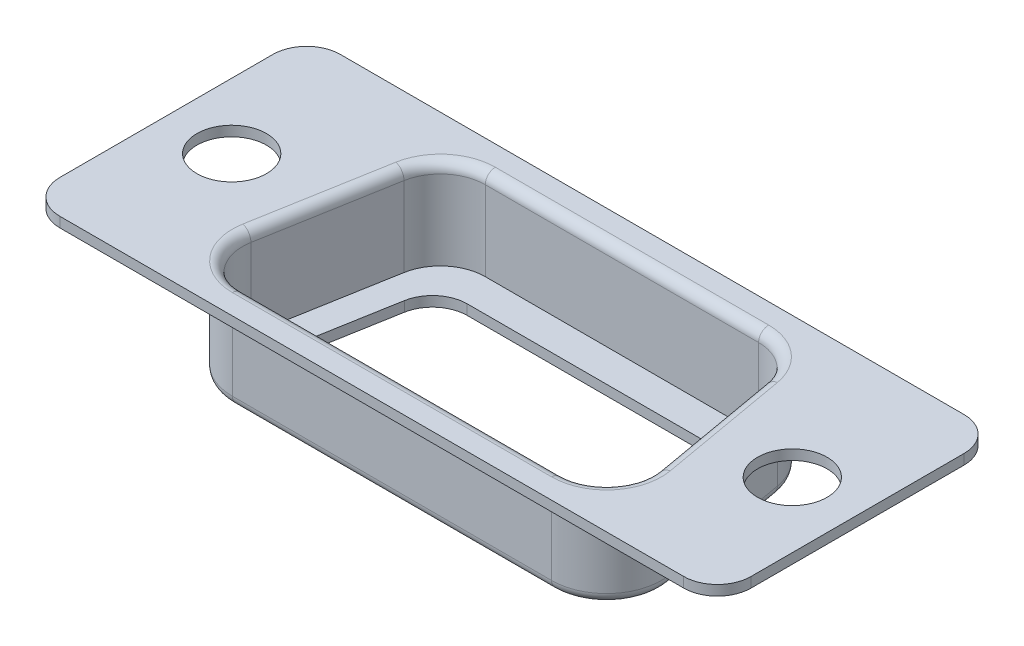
ISO-10303-21;
HEADER;
FILE_DESCRIPTION(('STEP AP214'),'2;1');
FILE_NAME('part.step','',(''),(''),'','','');
FILE_SCHEMA(('AUTOMOTIVE_DESIGN { 1 0 10303 214 1 1 1 1 }'));
ENDSEC;
DATA;
#1=APPLICATION_CONTEXT('core data for automotive mechanical design processes');
#2=APPLICATION_PROTOCOL_DEFINITION('international standard','automotive_design',2000,#1);
#3=PRODUCT_CONTEXT('',#1,'mechanical');
#4=PRODUCT('Part','Part','',(#3));
#5=PRODUCT_RELATED_PRODUCT_CATEGORY('part','',(#4));
#6=PRODUCT_DEFINITION_FORMATION('','',#4);
#7=PRODUCT_DEFINITION_CONTEXT('part definition',#1,'design');
#8=PRODUCT_DEFINITION('design','',#6,#7);
#9=PRODUCT_DEFINITION_SHAPE('','',#8);
#10=(LENGTH_UNIT() NAMED_UNIT(*) SI_UNIT(.MILLI.,.METRE.));
#11=(NAMED_UNIT(*) PLANE_ANGLE_UNIT() SI_UNIT($,.RADIAN.));
#12=(NAMED_UNIT(*) SI_UNIT($,.STERADIAN.) SOLID_ANGLE_UNIT());
#13=UNCERTAINTY_MEASURE_WITH_UNIT(LENGTH_MEASURE(1.E-05),#10,'distance_accuracy_value','');
#14=(GEOMETRIC_REPRESENTATION_CONTEXT(3) GLOBAL_UNCERTAINTY_ASSIGNED_CONTEXT((#13)) GLOBAL_UNIT_ASSIGNED_CONTEXT((#10,
#11,#12)) REPRESENTATION_CONTEXT('',''));
#15=CARTESIAN_POINT('',(0.,0.,0.));
#16=DIRECTION('',(0.,0.,1.));
#17=DIRECTION('',(1.,0.,0.));
#18=AXIS2_PLACEMENT_3D('',#15,#16,#17);
#19=CARTESIAN_POINT('',(-7.115,-4.,2.9));
#20=DIRECTION('',(0.,1.,0.));
#21=DIRECTION('',(0.,0.,1.));
#22=AXIS2_PLACEMENT_3D('',#19,#20,#21);
#23=PLANE('',#22);
#24=CARTESIAN_POINT('',(-6.115,-4.,1.9));
#25=DIRECTION('',(0.,1.,0.));
#26=DIRECTION('',(0.,0.,1.));
#27=AXIS2_PLACEMENT_3D('',#24,#25,#26);
#28=CIRCLE('',#27,1.55);
#29=CARTESIAN_POINT('',(-6.115,-4.,3.45));
#30=VERTEX_POINT('',#29);
#31=CARTESIAN_POINT('',(-7.64145201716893,-4.,1.63084532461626));
#32=VERTEX_POINT('',#31);
#33=EDGE_CURVE('E219',#30,#32,#28,.F.);
#34=ORIENTED_EDGE('',*,*,#33,.T.);
#35=DIRECTION('',(-0.17364817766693,0.,0.984807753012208));
#36=VECTOR('',#35,1.);
#37=CARTESIAN_POINT('',(-6.97140949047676,-4.,-2.16915467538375));
#38=LINE('',#37,#36);
#39=CARTESIAN_POINT('',(-6.97140949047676,-4.,-2.16915467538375));
#40=VERTEX_POINT('',#39);
#41=EDGE_CURVE('E215',#32,#40,#38,.F.);
#42=ORIENTED_EDGE('',*,*,#41,.T.);
#43=CARTESIAN_POINT('',(-5.44495747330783,-4.,-1.9));
#44=DIRECTION('',(0.,1.,0.));
#45=DIRECTION('',(0.,0.,1.));
#46=AXIS2_PLACEMENT_3D('',#43,#44,#45);
#47=CIRCLE('',#46,1.55);
#48=CARTESIAN_POINT('',(-5.44495747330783,-4.,-3.45));
#49=VERTEX_POINT('',#48);
#50=EDGE_CURVE('E196',#40,#49,#47,.F.);
#51=ORIENTED_EDGE('',*,*,#50,.T.);
#52=DIRECTION('',(-1.,0.,0.));
#53=VECTOR('',#52,1.);
#54=CARTESIAN_POINT('',(5.44495747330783,-4.,-3.45));
#55=LINE('',#54,#53);
#56=CARTESIAN_POINT('',(5.44495747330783,-4.,-3.45));
#57=VERTEX_POINT('',#56);
#58=EDGE_CURVE('E193',#49,#57,#55,.F.);
#59=ORIENTED_EDGE('',*,*,#58,.T.);
#60=CARTESIAN_POINT('',(5.44495747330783,-4.,-1.9));
#61=DIRECTION('',(0.,1.,0.));
#62=DIRECTION('',(0.,0.,1.));
#63=AXIS2_PLACEMENT_3D('',#60,#61,#62);
#64=CIRCLE('',#63,1.55);
#65=CARTESIAN_POINT('',(6.97140949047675,-4.,-2.16915467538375));
#66=VERTEX_POINT('',#65);
#67=EDGE_CURVE('E22',#57,#66,#64,.F.);
#68=ORIENTED_EDGE('',*,*,#67,.T.);
#69=DIRECTION('',(-0.17364817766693,0.,-0.984807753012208));
#70=VECTOR('',#69,1.);
#71=CARTESIAN_POINT('',(7.64145201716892,-4.,1.63084532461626));
#72=LINE('',#71,#70);
#73=CARTESIAN_POINT('',(7.64145201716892,-4.,1.63084532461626));
#74=VERTEX_POINT('',#73);
#75=EDGE_CURVE('E231',#66,#74,#72,.F.);
#76=ORIENTED_EDGE('',*,*,#75,.T.);
#77=CARTESIAN_POINT('',(6.115,-4.,1.9));
#78=DIRECTION('',(0.,1.,0.));
#79=DIRECTION('',(0.,0.,1.));
#80=AXIS2_PLACEMENT_3D('',#77,#78,#79);
#81=CIRCLE('',#80,1.55);
#82=CARTESIAN_POINT('',(6.115,-4.,3.45));
#83=VERTEX_POINT('',#82);
#84=EDGE_CURVE('E227',#74,#83,#81,.F.);
#85=ORIENTED_EDGE('',*,*,#84,.T.);
#86=DIRECTION('',(1.,0.,0.));
#87=VECTOR('',#86,1.);
#88=CARTESIAN_POINT('',(-6.115,-4.,3.45));
#89=LINE('',#88,#87);
#90=EDGE_CURVE('E223',#83,#30,#89,.F.);
#91=ORIENTED_EDGE('',*,*,#90,.T.);
#92=EDGE_LOOP('',(#34,#42,#51,#59,#68,#76,#85,#91));
#93=FACE_BOUND('',#92,.T.);
#94=CARTESIAN_POINT('',(-6.09230351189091,-4.,-2.9));
#95=DIRECTION('',(0.,1.,0.));
#96=DIRECTION('',(0.,0.,1.));
#97=AXIS2_PLACEMENT_3D('',#94,#95,#96);
#98=CIRCLE('',#97,2.);
#99=CARTESIAN_POINT('',(-6.09230351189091,-4.,-4.9));
#100=VERTEX_POINT('',#99);
#101=CARTESIAN_POINT('',(-8.06191901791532,-4.,-3.24729635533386));
#102=VERTEX_POINT('',#101);
#103=EDGE_CURVE('E200',#100,#102,#98,.T.);
#104=ORIENTED_EDGE('',*,*,#103,.T.);
#105=DIRECTION('',(-0.17364817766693,0.,0.984807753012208));
#106=VECTOR('',#105,1.);
#107=CARTESIAN_POINT('',(-8.06191901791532,-4.,-3.24729635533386));
#108=LINE('',#107,#106);
#109=CARTESIAN_POINT('',(-9.08461550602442,-4.,2.55270364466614));
#110=VERTEX_POINT('',#109);
#111=EDGE_CURVE('E245',#102,#110,#108,.T.);
#112=ORIENTED_EDGE('',*,*,#111,.T.);
#113=CARTESIAN_POINT('',(-7.115,-4.,2.9));
#114=DIRECTION('',(0.,1.,0.));
#115=DIRECTION('',(0.,0.,1.));
#116=AXIS2_PLACEMENT_3D('',#113,#114,#115);
#117=CIRCLE('',#116,2.);
#118=CARTESIAN_POINT('',(-7.115,-4.,4.9));
#119=VERTEX_POINT('',#118);
#120=EDGE_CURVE('E327',#110,#119,#117,.T.);
#121=ORIENTED_EDGE('',*,*,#120,.T.);
#122=DIRECTION('',(1.,0.,0.));
#123=VECTOR('',#122,1.);
#124=CARTESIAN_POINT('',(-7.115,-4.,4.9));
#125=LINE('',#124,#123);
#126=CARTESIAN_POINT('',(7.115,-4.,4.9));
#127=VERTEX_POINT('',#126);
#128=EDGE_CURVE('E241',#119,#127,#125,.T.);
#129=ORIENTED_EDGE('',*,*,#128,.T.);
#130=CARTESIAN_POINT('',(7.115,-4.,2.9));
#131=DIRECTION('',(0.,1.,0.));
#132=DIRECTION('',(0.,0.,1.));
#133=AXIS2_PLACEMENT_3D('',#130,#131,#132);
#134=CIRCLE('',#133,2.);
#135=CARTESIAN_POINT('',(9.08461550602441,-4.,2.55270364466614));
#136=VERTEX_POINT('',#135);
#137=EDGE_CURVE('E325',#127,#136,#134,.T.);
#138=ORIENTED_EDGE('',*,*,#137,.T.);
#139=DIRECTION('',(-0.17364817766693,0.,-0.984807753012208));
#140=VECTOR('',#139,1.);
#141=CARTESIAN_POINT('',(9.08461550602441,-4.,2.55270364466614));
#142=LINE('',#141,#140);
#143=CARTESIAN_POINT('',(8.06191901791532,-4.,-3.24729635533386));
#144=VERTEX_POINT('',#143);
#145=EDGE_CURVE('E237',#136,#144,#142,.T.);
#146=ORIENTED_EDGE('',*,*,#145,.T.);
#147=CARTESIAN_POINT('',(6.09230351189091,-4.,-2.9));
#148=DIRECTION('',(0.,1.,0.));
#149=DIRECTION('',(0.,0.,1.));
#150=AXIS2_PLACEMENT_3D('',#147,#148,#149);
#151=CIRCLE('',#150,2.);
#152=CARTESIAN_POINT('',(6.09230351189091,-4.,-4.9));
#153=VERTEX_POINT('',#152);
#154=EDGE_CURVE('E323',#144,#153,#151,.T.);
#155=ORIENTED_EDGE('',*,*,#154,.T.);
#156=DIRECTION('',(1.,0.,0.));
#157=VECTOR('',#156,1.);
#158=CARTESIAN_POINT('',(6.09230351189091,-4.,-4.9));
#159=LINE('',#158,#157);
#160=EDGE_CURVE('E233',#153,#100,#159,.F.);
#161=ORIENTED_EDGE('',*,*,#160,.T.);
#162=EDGE_LOOP('',(#104,#112,#121,#129,#138,#146,#155,#161));
#163=FACE_BOUND('',#162,.T.);
#164=ADVANCED_FACE('F19',(#93,#163),#23,.T.);
#165=CARTESIAN_POINT('',(5.44495747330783,-33.545619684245,-1.9));
#166=DIRECTION('',(0.,1.,0.));
#167=DIRECTION('',(0.,0.,1.));
#168=AXIS2_PLACEMENT_3D('',#165,#166,#167);
#169=CYLINDRICAL_SURFACE('',#168,1.55);
#170=DIRECTION('',(0.,1.,0.));
#171=VECTOR('',#170,1.);
#172=CARTESIAN_POINT('',(5.44495747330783,-33.545619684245,-3.45));
#173=LINE('',#172,#171);
#174=CARTESIAN_POINT('',(5.44495747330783,-4.45,-3.45));
#175=VERTEX_POINT('',#174);
#176=EDGE_CURVE('E186',#57,#175,#173,.F.);
#177=ORIENTED_EDGE('',*,*,#176,.T.);
#178=CARTESIAN_POINT('',(5.44495747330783,-4.45,-1.9));
#179=DIRECTION('',(0.,1.,0.));
#180=DIRECTION('',(0.,0.,1.));
#181=AXIS2_PLACEMENT_3D('',#178,#179,#180);
#182=CIRCLE('',#181,1.55);
#183=CARTESIAN_POINT('',(6.97140949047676,-4.45,-2.16915467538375));
#184=VERTEX_POINT('',#183);
#185=EDGE_CURVE('E320',#175,#184,#182,.F.);
#186=ORIENTED_EDGE('',*,*,#185,.T.);
#187=DIRECTION('',(0.,1.,0.));
#188=VECTOR('',#187,1.);
#189=CARTESIAN_POINT('',(6.97140949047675,-33.545619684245,-2.16915467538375));
#190=LINE('',#189,#188);
#191=EDGE_CURVE('E189',#184,#66,#190,.T.);
#192=ORIENTED_EDGE('',*,*,#191,.T.);
#193=ORIENTED_EDGE('',*,*,#67,.F.);
#194=EDGE_LOOP('',(#177,#186,#192,#193));
#195=FACE_BOUND('',#194,.T.);
#196=ADVANCED_FACE('F184',(#195),#169,.F.);
#197=CARTESIAN_POINT('',(7.64145201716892,-33.545619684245,1.63084532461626));
#198=DIRECTION('',(0.984807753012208,0.,-0.17364817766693));
#199=DIRECTION('',(-0.17364817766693,0.,-0.984807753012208));
#200=AXIS2_PLACEMENT_3D('',#197,#198,#199);
#201=PLANE('',#200);
#202=ORIENTED_EDGE('',*,*,#191,.F.);
#203=DIRECTION('',(0.173648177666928,0.,0.984807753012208));
#204=VECTOR('',#203,1.);
#205=CARTESIAN_POINT('',(6.97140949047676,-4.45,-2.16915467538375));
#206=LINE('',#205,#204);
#207=CARTESIAN_POINT('',(7.64145201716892,-4.45,1.63084532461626));
#208=VERTEX_POINT('',#207);
#209=EDGE_CURVE('E319',#184,#208,#206,.T.);
#210=ORIENTED_EDGE('',*,*,#209,.T.);
#211=DIRECTION('',(0.,1.,0.));
#212=VECTOR('',#211,1.);
#213=CARTESIAN_POINT('',(7.64145201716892,-33.545619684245,1.63084532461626));
#214=LINE('',#213,#212);
#215=EDGE_CURVE('E228',#208,#74,#214,.T.);
#216=ORIENTED_EDGE('',*,*,#215,.T.);
#217=ORIENTED_EDGE('',*,*,#75,.F.);
#218=EDGE_LOOP('',(#202,#210,#216,#217));
#219=FACE_BOUND('',#218,.T.);
#220=ADVANCED_FACE('F1371',(#219),#201,.F.);
#221=CARTESIAN_POINT('',(6.115,-33.545619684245,1.9));
#222=DIRECTION('',(0.,1.,0.));
#223=DIRECTION('',(0.,0.,1.));
#224=AXIS2_PLACEMENT_3D('',#221,#222,#223);
#225=CYLINDRICAL_SURFACE('',#224,1.55);
#226=ORIENTED_EDGE('',*,*,#215,.F.);
#227=CARTESIAN_POINT('',(6.115,-4.45,1.9));
#228=DIRECTION('',(0.,1.,0.));
#229=DIRECTION('',(0.,0.,1.));
#230=AXIS2_PLACEMENT_3D('',#227,#228,#229);
#231=CIRCLE('',#230,1.55);
#232=CARTESIAN_POINT('',(6.115,-4.45,3.45));
#233=VERTEX_POINT('',#232);
#234=EDGE_CURVE('E317',#208,#233,#231,.F.);
#235=ORIENTED_EDGE('',*,*,#234,.T.);
#236=DIRECTION('',(0.,1.,0.));
#237=VECTOR('',#236,1.);
#238=CARTESIAN_POINT('',(6.115,-33.545619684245,3.45));
#239=LINE('',#238,#237);
#240=EDGE_CURVE('E224',#233,#83,#239,.T.);
#241=ORIENTED_EDGE('',*,*,#240,.T.);
#242=ORIENTED_EDGE('',*,*,#84,.F.);
#243=EDGE_LOOP('',(#226,#235,#241,#242));
#244=FACE_BOUND('',#243,.T.);
#245=ADVANCED_FACE('F335',(#244),#225,.F.);
#246=CARTESIAN_POINT('',(-6.115,-33.545619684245,3.45));
#247=DIRECTION('',(0.,0.,1.));
#248=DIRECTION('',(1.,0.,0.));
#249=AXIS2_PLACEMENT_3D('',#246,#247,#248);
#250=PLANE('',#249);
#251=ORIENTED_EDGE('',*,*,#240,.F.);
#252=DIRECTION('',(1.,0.,0.));
#253=VECTOR('',#252,1.);
#254=CARTESIAN_POINT('',(-7.115,-4.45,3.45));
#255=LINE('',#254,#253);
#256=CARTESIAN_POINT('',(-6.115,-4.45,3.45));
#257=VERTEX_POINT('',#256);
#258=EDGE_CURVE('E316',#233,#257,#255,.F.);
#259=ORIENTED_EDGE('',*,*,#258,.T.);
#260=DIRECTION('',(0.,1.,0.));
#261=VECTOR('',#260,1.);
#262=CARTESIAN_POINT('',(-6.115,-33.545619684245,3.45));
#263=LINE('',#262,#261);
#264=EDGE_CURVE('E220',#257,#30,#263,.T.);
#265=ORIENTED_EDGE('',*,*,#264,.T.);
#266=ORIENTED_EDGE('',*,*,#90,.F.);
#267=EDGE_LOOP('',(#251,#259,#265,#266));
#268=FACE_BOUND('',#267,.T.);
#269=ADVANCED_FACE('F339',(#268),#250,.F.);
#270=CARTESIAN_POINT('',(-6.115,-33.545619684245,1.9));
#271=DIRECTION('',(0.,1.,0.));
#272=DIRECTION('',(0.,0.,1.));
#273=AXIS2_PLACEMENT_3D('',#270,#271,#272);
#274=CYLINDRICAL_SURFACE('',#273,1.55);
#275=ORIENTED_EDGE('',*,*,#264,.F.);
#276=CARTESIAN_POINT('',(-6.115,-4.45,1.9));
#277=DIRECTION('',(0.,1.,0.));
#278=DIRECTION('',(0.,0.,1.));
#279=AXIS2_PLACEMENT_3D('',#276,#277,#278);
#280=CIRCLE('',#279,1.55);
#281=CARTESIAN_POINT('',(-7.64145201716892,-4.45,1.63084532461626));
#282=VERTEX_POINT('',#281);
#283=EDGE_CURVE('E314',#257,#282,#280,.F.);
#284=ORIENTED_EDGE('',*,*,#283,.T.);
#285=DIRECTION('',(0.,1.,0.));
#286=VECTOR('',#285,1.);
#287=CARTESIAN_POINT('',(-7.64145201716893,-33.545619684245,1.63084532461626));
#288=LINE('',#287,#286);
#289=EDGE_CURVE('E216',#282,#32,#288,.T.);
#290=ORIENTED_EDGE('',*,*,#289,.T.);
#291=ORIENTED_EDGE('',*,*,#33,.F.);
#292=EDGE_LOOP('',(#275,#284,#290,#291));
#293=FACE_BOUND('',#292,.T.);
#294=ADVANCED_FACE('F344',(#293),#274,.F.);
#295=CARTESIAN_POINT('',(-6.97140949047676,-33.545619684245,-2.16915467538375));
#296=DIRECTION('',(-0.984807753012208,0.,-0.17364817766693));
#297=DIRECTION('',(-0.17364817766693,0.,0.984807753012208));
#298=AXIS2_PLACEMENT_3D('',#295,#296,#297);
#299=PLANE('',#298);
#300=ORIENTED_EDGE('',*,*,#289,.F.);
#301=DIRECTION('',(0.173648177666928,0.,-0.984807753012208));
#302=VECTOR('',#301,1.);
#303=CARTESIAN_POINT('',(-7.64145201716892,-4.45,1.63084532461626));
#304=LINE('',#303,#302);
#305=CARTESIAN_POINT('',(-6.97140949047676,-4.45,-2.16915467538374));
#306=VERTEX_POINT('',#305);
#307=EDGE_CURVE('E313',#282,#306,#304,.T.);
#308=ORIENTED_EDGE('',*,*,#307,.T.);
#309=DIRECTION('',(0.,1.,0.));
#310=VECTOR('',#309,1.);
#311=CARTESIAN_POINT('',(-6.97140949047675,-33.545619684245,-2.16915467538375));
#312=LINE('',#311,#310);
#313=EDGE_CURVE('E209',#306,#40,#312,.T.);
#314=ORIENTED_EDGE('',*,*,#313,.T.);
#315=ORIENTED_EDGE('',*,*,#41,.F.);
#316=EDGE_LOOP('',(#300,#308,#314,#315));
#317=FACE_BOUND('',#316,.T.);
#318=ADVANCED_FACE('F349',(#317),#299,.F.);
#319=CARTESIAN_POINT('',(-5.44495747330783,-33.545619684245,-1.9));
#320=DIRECTION('',(0.,1.,0.));
#321=DIRECTION('',(0.,0.,1.));
#322=AXIS2_PLACEMENT_3D('',#319,#320,#321);
#323=CYLINDRICAL_SURFACE('',#322,1.55);
#324=ORIENTED_EDGE('',*,*,#313,.F.);
#325=CARTESIAN_POINT('',(-5.44495747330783,-4.45,-1.9));
#326=DIRECTION('',(0.,1.,0.));
#327=DIRECTION('',(0.,0.,1.));
#328=AXIS2_PLACEMENT_3D('',#325,#326,#327);
#329=CIRCLE('',#328,1.55);
#330=CARTESIAN_POINT('',(-5.44495747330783,-4.45,-3.45));
#331=VERTEX_POINT('',#330);
#332=EDGE_CURVE('E311',#306,#331,#329,.F.);
#333=ORIENTED_EDGE('',*,*,#332,.T.);
#334=DIRECTION('',(0.,1.,0.));
#335=VECTOR('',#334,1.);
#336=CARTESIAN_POINT('',(-5.44495747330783,-33.545619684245,-3.45));
#337=LINE('',#336,#335);
#338=EDGE_CURVE('E201',#331,#49,#337,.T.);
#339=ORIENTED_EDGE('',*,*,#338,.T.);
#340=ORIENTED_EDGE('',*,*,#50,.F.);
#341=EDGE_LOOP('',(#324,#333,#339,#340));
#342=FACE_BOUND('',#341,.T.);
#343=ADVANCED_FACE('F353',(#342),#323,.F.);
#344=CARTESIAN_POINT('',(5.44495747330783,-33.545619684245,-3.45));
#345=DIRECTION('',(0.,0.,-1.));
#346=DIRECTION('',(-1.,0.,0.));
#347=AXIS2_PLACEMENT_3D('',#344,#345,#346);
#348=PLANE('',#347);
#349=ORIENTED_EDGE('',*,*,#338,.F.);
#350=DIRECTION('',(1.,0.,0.));
#351=VECTOR('',#350,1.);
#352=CARTESIAN_POINT('',(-7.115,-4.45,-3.45));
#353=LINE('',#352,#351);
#354=EDGE_CURVE('E205',#331,#175,#353,.T.);
#355=ORIENTED_EDGE('',*,*,#354,.T.);
#356=ORIENTED_EDGE('',*,*,#176,.F.);
#357=ORIENTED_EDGE('',*,*,#58,.F.);
#358=EDGE_LOOP('',(#349,#355,#356,#357));
#359=FACE_BOUND('',#358,.T.);
#360=ADVANCED_FACE('F203',(#359),#348,.F.);
#361=CARTESIAN_POINT('',(-6.09230351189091,-4.45,-2.9));
#362=DIRECTION('',(0.,1.,0.));
#363=DIRECTION('',(0.,0.,1.));
#364=AXIS2_PLACEMENT_3D('',#361,#362,#363);
#365=CYLINDRICAL_SURFACE('',#364,2.);
#366=CARTESIAN_POINT('',(-6.09230351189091,-0.45,-2.9));
#367=DIRECTION('',(0.,-1.,0.));
#368=DIRECTION('',(0.,0.,-1.));
#369=AXIS2_PLACEMENT_3D('',#366,#367,#368);
#370=CIRCLE('',#369,2.);
#371=CARTESIAN_POINT('',(-8.06191901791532,-0.45,-3.24729635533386));
#372=VERTEX_POINT('',#371);
#373=CARTESIAN_POINT('',(-6.09230351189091,-0.45,-4.9));
#374=VERTEX_POINT('',#373);
#375=EDGE_CURVE('E358',#372,#374,#370,.T.);
#376=ORIENTED_EDGE('',*,*,#375,.F.);
#377=DIRECTION('',(0.,1.,0.));
#378=VECTOR('',#377,1.);
#379=CARTESIAN_POINT('',(-8.06191901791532,-4.45,-3.24729635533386));
#380=LINE('',#379,#378);
#381=EDGE_CURVE('E246',#372,#102,#380,.F.);
#382=ORIENTED_EDGE('',*,*,#381,.T.);
#383=ORIENTED_EDGE('',*,*,#103,.F.);
#384=DIRECTION('',(0.,1.,0.));
#385=VECTOR('',#384,1.);
#386=CARTESIAN_POINT('',(-6.09230351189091,-4.45,-4.9));
#387=LINE('',#386,#385);
#388=EDGE_CURVE('E235',#100,#374,#387,.T.);
#389=ORIENTED_EDGE('',*,*,#388,.T.);
#390=EDGE_LOOP('',(#376,#382,#383,#389));
#391=FACE_BOUND('',#390,.T.);
#392=ADVANCED_FACE('F614',(#391),#365,.F.);
#393=CARTESIAN_POINT('',(-8.06191901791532,-4.45,-3.24729635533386));
#394=DIRECTION('',(-0.984807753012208,0.,-0.17364817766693));
#395=DIRECTION('',(-0.17364817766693,0.,0.984807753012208));
#396=AXIS2_PLACEMENT_3D('',#393,#394,#395);
#397=PLANE('',#396);
#398=DIRECTION('',(-0.17364817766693,0.,0.984807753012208));
#399=VECTOR('',#398,1.);
#400=CARTESIAN_POINT('',(-8.06191901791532,-0.45,-3.24729635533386));
#401=LINE('',#400,#399);
#402=CARTESIAN_POINT('',(-9.08461550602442,-0.45,2.55270364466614));
#403=VERTEX_POINT('',#402);
#404=EDGE_CURVE('E361',#403,#372,#401,.F.);
#405=ORIENTED_EDGE('',*,*,#404,.F.);
#406=DIRECTION('',(0.,1.,0.));
#407=VECTOR('',#406,1.);
#408=CARTESIAN_POINT('',(-9.08461550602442,-4.45,2.55270364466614));
#409=LINE('',#408,#407);
#410=EDGE_CURVE('E244',#403,#110,#409,.F.);
#411=ORIENTED_EDGE('',*,*,#410,.T.);
#412=ORIENTED_EDGE('',*,*,#111,.F.);
#413=ORIENTED_EDGE('',*,*,#381,.F.);
#414=EDGE_LOOP('',(#405,#411,#412,#413));
#415=FACE_BOUND('',#414,.T.);
#416=ADVANCED_FACE('F619',(#415),#397,.F.);
#417=CARTESIAN_POINT('',(-7.115,-4.45,2.9));
#418=DIRECTION('',(0.,1.,0.));
#419=DIRECTION('',(0.,0.,1.));
#420=AXIS2_PLACEMENT_3D('',#417,#418,#419);
#421=CYLINDRICAL_SURFACE('',#420,2.);
#422=CARTESIAN_POINT('',(-7.115,-0.45,2.9));
#423=DIRECTION('',(0.,-1.,0.));
#424=DIRECTION('',(0.,0.,-1.));
#425=AXIS2_PLACEMENT_3D('',#422,#423,#424);
#426=CIRCLE('',#425,2.);
#427=CARTESIAN_POINT('',(-7.115,-0.45,4.9));
#428=VERTEX_POINT('',#427);
#429=EDGE_CURVE('E592',#428,#403,#426,.T.);
#430=ORIENTED_EDGE('',*,*,#429,.F.);
#431=DIRECTION('',(0.,-1.,0.));
#432=VECTOR('',#431,1.);
#433=CARTESIAN_POINT('',(-7.115,-4.45,4.9));
#434=LINE('',#433,#432);
#435=EDGE_CURVE('E243',#428,#119,#434,.T.);
#436=ORIENTED_EDGE('',*,*,#435,.T.);
#437=ORIENTED_EDGE('',*,*,#120,.F.);
#438=ORIENTED_EDGE('',*,*,#410,.F.);
#439=EDGE_LOOP('',(#430,#436,#437,#438));
#440=FACE_BOUND('',#439,.T.);
#441=ADVANCED_FACE('F1296',(#440),#421,.F.);
#442=CARTESIAN_POINT('',(-7.115,-4.45,4.9));
#443=DIRECTION('',(0.,0.,1.));
#444=DIRECTION('',(0.,-1.,0.));
#445=AXIS2_PLACEMENT_3D('',#442,#443,#444);
#446=PLANE('',#445);
#447=DIRECTION('',(1.,0.,0.));
#448=VECTOR('',#447,1.);
#449=CARTESIAN_POINT('',(-7.115,-0.45,4.9));
#450=LINE('',#449,#448);
#451=CARTESIAN_POINT('',(7.115,-0.45,4.9));
#452=VERTEX_POINT('',#451);
#453=EDGE_CURVE('E582',#452,#428,#450,.F.);
#454=ORIENTED_EDGE('',*,*,#453,.F.);
#455=DIRECTION('',(0.,1.,0.));
#456=VECTOR('',#455,1.);
#457=CARTESIAN_POINT('',(7.115,-4.45,4.9));
#458=LINE('',#457,#456);
#459=EDGE_CURVE('E240',#452,#127,#458,.F.);
#460=ORIENTED_EDGE('',*,*,#459,.T.);
#461=ORIENTED_EDGE('',*,*,#128,.F.);
#462=ORIENTED_EDGE('',*,*,#435,.F.);
#463=EDGE_LOOP('',(#454,#460,#461,#462));
#464=FACE_BOUND('',#463,.T.);
#465=ADVANCED_FACE('F1286',(#464),#446,.F.);
#466=CARTESIAN_POINT('',(7.115,-4.45,2.9));
#467=DIRECTION('',(0.,1.,0.));
#468=DIRECTION('',(0.,0.,1.));
#469=AXIS2_PLACEMENT_3D('',#466,#467,#468);
#470=CYLINDRICAL_SURFACE('',#469,2.);
#471=CARTESIAN_POINT('',(7.115,-0.45,2.9));
#472=DIRECTION('',(0.,-1.,0.));
#473=DIRECTION('',(0.,0.,-1.));
#474=AXIS2_PLACEMENT_3D('',#471,#472,#473);
#475=CIRCLE('',#474,2.);
#476=CARTESIAN_POINT('',(9.08461550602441,-0.45,2.55270364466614));
#477=VERTEX_POINT('',#476);
#478=EDGE_CURVE('E572',#477,#452,#475,.T.);
#479=ORIENTED_EDGE('',*,*,#478,.F.);
#480=DIRECTION('',(0.,1.,0.));
#481=VECTOR('',#480,1.);
#482=CARTESIAN_POINT('',(9.08461550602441,-4.45,2.55270364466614));
#483=LINE('',#482,#481);
#484=EDGE_CURVE('E239',#477,#136,#483,.F.);
#485=ORIENTED_EDGE('',*,*,#484,.T.);
#486=ORIENTED_EDGE('',*,*,#137,.F.);
#487=ORIENTED_EDGE('',*,*,#459,.F.);
#488=EDGE_LOOP('',(#479,#485,#486,#487));
#489=FACE_BOUND('',#488,.T.);
#490=ADVANCED_FACE('F1276',(#489),#470,.F.);
#491=CARTESIAN_POINT('',(9.08461550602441,-4.45,2.55270364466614));
#492=DIRECTION('',(0.984807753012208,0.,-0.17364817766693));
#493=DIRECTION('',(-0.17364817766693,0.,-0.984807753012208));
#494=AXIS2_PLACEMENT_3D('',#491,#492,#493);
#495=PLANE('',#494);
#496=DIRECTION('',(-0.17364817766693,0.,-0.984807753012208));
#497=VECTOR('',#496,1.);
#498=CARTESIAN_POINT('',(9.08461550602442,-0.45,2.55270364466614));
#499=LINE('',#498,#497);
#500=CARTESIAN_POINT('',(8.06191901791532,-0.45,-3.24729635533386));
#501=VERTEX_POINT('',#500);
#502=EDGE_CURVE('E562',#501,#477,#499,.F.);
#503=ORIENTED_EDGE('',*,*,#502,.F.);
#504=DIRECTION('',(0.,1.,0.));
#505=VECTOR('',#504,1.);
#506=CARTESIAN_POINT('',(8.06191901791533,-4.45,-3.24729635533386));
#507=LINE('',#506,#505);
#508=EDGE_CURVE('E236',#501,#144,#507,.F.);
#509=ORIENTED_EDGE('',*,*,#508,.T.);
#510=ORIENTED_EDGE('',*,*,#145,.F.);
#511=ORIENTED_EDGE('',*,*,#484,.F.);
#512=EDGE_LOOP('',(#503,#509,#510,#511));
#513=FACE_BOUND('',#512,.T.);
#514=ADVANCED_FACE('F1266',(#513),#495,.F.);
#515=CARTESIAN_POINT('',(6.09230351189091,-4.45,-2.9));
#516=DIRECTION('',(0.,1.,0.));
#517=DIRECTION('',(0.,0.,1.));
#518=AXIS2_PLACEMENT_3D('',#515,#516,#517);
#519=CYLINDRICAL_SURFACE('',#518,2.);
#520=CARTESIAN_POINT('',(6.09230351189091,-0.45,-2.9));
#521=DIRECTION('',(0.,-1.,0.));
#522=DIRECTION('',(0.,0.,-1.));
#523=AXIS2_PLACEMENT_3D('',#520,#521,#522);
#524=CIRCLE('',#523,2.);
#525=CARTESIAN_POINT('',(6.09230351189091,-0.45,-4.9));
#526=VERTEX_POINT('',#525);
#527=EDGE_CURVE('E530',#526,#501,#524,.T.);
#528=ORIENTED_EDGE('',*,*,#527,.F.);
#529=DIRECTION('',(0.,1.,0.));
#530=VECTOR('',#529,1.);
#531=CARTESIAN_POINT('',(6.09230351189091,-4.45,-4.9));
#532=LINE('',#531,#530);
#533=EDGE_CURVE('E322',#526,#153,#532,.F.);
#534=ORIENTED_EDGE('',*,*,#533,.T.);
#535=ORIENTED_EDGE('',*,*,#154,.F.);
#536=ORIENTED_EDGE('',*,*,#508,.F.);
#537=EDGE_LOOP('',(#528,#534,#535,#536));
#538=FACE_BOUND('',#537,.T.);
#539=ADVANCED_FACE('F1258',(#538),#519,.F.);
#540=CARTESIAN_POINT('',(6.09230351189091,-4.45,-4.9));
#541=DIRECTION('',(0.,0.,-1.));
#542=DIRECTION('',(0.,1.,0.));
#543=AXIS2_PLACEMENT_3D('',#540,#541,#542);
#544=PLANE('',#543);
#545=DIRECTION('',(-1.,0.,0.));
#546=VECTOR('',#545,1.);
#547=CARTESIAN_POINT('',(6.09230351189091,-0.45,-4.9));
#548=LINE('',#547,#546);
#549=EDGE_CURVE('E542',#374,#526,#548,.F.);
#550=ORIENTED_EDGE('',*,*,#549,.F.);
#551=ORIENTED_EDGE('',*,*,#388,.F.);
#552=ORIENTED_EDGE('',*,*,#160,.F.);
#553=ORIENTED_EDGE('',*,*,#533,.F.);
#554=EDGE_LOOP('',(#550,#551,#552,#553));
#555=FACE_BOUND('',#554,.T.);
#556=ADVANCED_FACE('F627',(#555),#544,.F.);
#557=CARTESIAN_POINT('',(-7.115,-4.45,2.9));
#558=DIRECTION('',(0.,1.,0.));
#559=DIRECTION('',(0.,0.,1.));
#560=AXIS2_PLACEMENT_3D('',#557,#558,#559);
#561=PLANE('',#560);
#562=ORIENTED_EDGE('',*,*,#332,.F.);
#563=ORIENTED_EDGE('',*,*,#307,.F.);
#564=ORIENTED_EDGE('',*,*,#283,.F.);
#565=ORIENTED_EDGE('',*,*,#258,.F.);
#566=ORIENTED_EDGE('',*,*,#234,.F.);
#567=ORIENTED_EDGE('',*,*,#209,.F.);
#568=ORIENTED_EDGE('',*,*,#185,.F.);
#569=ORIENTED_EDGE('',*,*,#354,.F.);
#570=EDGE_LOOP('',(#562,#563,#564,#565,#566,#567,#568,#569));
#571=FACE_BOUND('',#570,.T.);
#572=CARTESIAN_POINT('',(6.09230351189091,-4.45,-2.9));
#573=DIRECTION('',(0.,1.,0.));
#574=DIRECTION('',(0.984807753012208,0.,-0.173648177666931));
#575=AXIS2_PLACEMENT_3D('',#572,#573,#574);
#576=CIRCLE('',#575,1.99999999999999);
#577=CARTESIAN_POINT('',(8.06191901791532,-4.45,-3.24729635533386));
#578=VERTEX_POINT('',#577);
#579=CARTESIAN_POINT('',(6.09230351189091,-4.45,-4.9));
#580=VERTEX_POINT('',#579);
#581=EDGE_CURVE('E428',#578,#580,#576,.T.);
#582=ORIENTED_EDGE('',*,*,#581,.F.);
#583=DIRECTION('',(0.17364817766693,0.,0.984807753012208));
#584=VECTOR('',#583,1.);
#585=CARTESIAN_POINT('',(9.08461550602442,-4.45,2.55270364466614));
#586=LINE('',#585,#584);
#587=CARTESIAN_POINT('',(9.08461550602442,-4.45,2.55270364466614));
#588=VERTEX_POINT('',#587);
#589=EDGE_CURVE('E454',#588,#578,#586,.F.);
#590=ORIENTED_EDGE('',*,*,#589,.F.);
#591=CARTESIAN_POINT('',(7.115,-4.45,2.9));
#592=DIRECTION('',(0.,1.,0.));
#593=DIRECTION('',(0.,0.,1.));
#594=AXIS2_PLACEMENT_3D('',#591,#592,#593);
#595=CIRCLE('',#594,2.);
#596=CARTESIAN_POINT('',(7.115,-4.45,4.9));
#597=VERTEX_POINT('',#596);
#598=EDGE_CURVE('E472',#597,#588,#595,.T.);
#599=ORIENTED_EDGE('',*,*,#598,.F.);
#600=DIRECTION('',(-1.,0.,0.));
#601=VECTOR('',#600,1.);
#602=CARTESIAN_POINT('',(-7.115,-4.45,4.9));
#603=LINE('',#602,#601);
#604=CARTESIAN_POINT('',(-7.115,-4.45,4.9));
#605=VERTEX_POINT('',#604);
#606=EDGE_CURVE('E477',#605,#597,#603,.F.);
#607=ORIENTED_EDGE('',*,*,#606,.F.);
#608=CARTESIAN_POINT('',(-7.115,-4.45,2.9));
#609=DIRECTION('',(0.,1.,0.));
#610=DIRECTION('',(-0.984807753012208,0.,-0.17364817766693));
#611=AXIS2_PLACEMENT_3D('',#608,#609,#610);
#612=CIRCLE('',#611,2.);
#613=CARTESIAN_POINT('',(-9.08461550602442,-4.45,2.55270364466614));
#614=VERTEX_POINT('',#613);
#615=EDGE_CURVE('E510',#614,#605,#612,.T.);
#616=ORIENTED_EDGE('',*,*,#615,.F.);
#617=DIRECTION('',(0.17364817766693,0.,-0.984807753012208));
#618=VECTOR('',#617,1.);
#619=CARTESIAN_POINT('',(-8.06191901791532,-4.45,-3.24729635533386));
#620=LINE('',#619,#618);
#621=CARTESIAN_POINT('',(-8.06191901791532,-4.45,-3.24729635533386));
#622=VERTEX_POINT('',#621);
#623=EDGE_CURVE('E372',#622,#614,#620,.F.);
#624=ORIENTED_EDGE('',*,*,#623,.F.);
#625=CARTESIAN_POINT('',(-6.09230351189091,-4.45,-2.9));
#626=DIRECTION('',(0.,1.,0.));
#627=DIRECTION('',(0.,0.,-1.));
#628=AXIS2_PLACEMENT_3D('',#625,#626,#627);
#629=CIRCLE('',#628,2.);
#630=CARTESIAN_POINT('',(-6.09230351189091,-4.45,-4.9));
#631=VERTEX_POINT('',#630);
#632=EDGE_CURVE('E386',#631,#622,#629,.T.);
#633=ORIENTED_EDGE('',*,*,#632,.F.);
#634=DIRECTION('',(1.,0.,0.));
#635=VECTOR('',#634,1.);
#636=CARTESIAN_POINT('',(6.09230351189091,-4.45,-4.9));
#637=LINE('',#636,#635);
#638=EDGE_CURVE('E392',#580,#631,#637,.F.);
#639=ORIENTED_EDGE('',*,*,#638,.F.);
#640=EDGE_LOOP('',(#582,#590,#599,#607,#616,#624,#633,#639));
#641=FACE_BOUND('',#640,.T.);
#642=ADVANCED_FACE('F355',(#571,#641),#561,.F.);
#643=CARTESIAN_POINT('',(-6.09230351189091,-0.45,-2.9));
#644=DIRECTION('',(0.,-1.,0.));
#645=DIRECTION('',(0.,0.,-1.));
#646=AXIS2_PLACEMENT_3D('',#643,#644,#645);
#647=TOROIDAL_SURFACE('',#646,2.45,0.45);
#648=CARTESIAN_POINT('',(-6.09230351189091,-0.45,-5.35));
#649=DIRECTION('',(-1.,0.,0.));
#650=DIRECTION('',(0.,0.,1.));
#651=AXIS2_PLACEMENT_3D('',#648,#649,#650);
#652=CIRCLE('',#651,0.45);
#653=CARTESIAN_POINT('',(-6.09230351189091,0.,-5.35));
#654=VERTEX_POINT('',#653);
#655=EDGE_CURVE('E538',#654,#374,#652,.F.);
#656=ORIENTED_EDGE('',*,*,#655,.F.);
#657=CARTESIAN_POINT('',(-6.09230351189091,0.,-2.9));
#658=DIRECTION('',(0.,1.,0.));
#659=DIRECTION('',(0.,0.,-1.));
#660=AXIS2_PLACEMENT_3D('',#657,#658,#659);
#661=CIRCLE('',#660,2.45);
#662=CARTESIAN_POINT('',(-8.50508250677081,0.,-3.32543803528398));
#663=VERTEX_POINT('',#662);
#664=EDGE_CURVE('E375',#654,#663,#661,.T.);
#665=ORIENTED_EDGE('',*,*,#664,.T.);
#666=CARTESIAN_POINT('',(-8.50508250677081,-0.45,-3.32543803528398));
#667=DIRECTION('',(-0.17364817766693,0.,0.984807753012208));
#668=DIRECTION('',(0.984807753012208,0.,0.17364817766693));
#669=AXIS2_PLACEMENT_3D('',#666,#667,#668);
#670=CIRCLE('',#669,0.45);
#671=EDGE_CURVE('E604',#372,#663,#670,.T.);
#672=ORIENTED_EDGE('',*,*,#671,.F.);
#673=ORIENTED_EDGE('',*,*,#375,.T.);
#674=EDGE_LOOP('',(#656,#665,#672,#673));
#675=FACE_BOUND('',#674,.T.);
#676=ADVANCED_FACE('F636',(#675),#647,.T.);
#677=CARTESIAN_POINT('',(-8.50508250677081,-0.45,-3.32543803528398));
#678=DIRECTION('',(-0.17364817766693,0.,0.984807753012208));
#679=DIRECTION('',(0.984807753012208,0.,0.17364817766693));
#680=AXIS2_PLACEMENT_3D('',#677,#678,#679);
#681=CYLINDRICAL_SURFACE('',#680,0.45);
#682=ORIENTED_EDGE('',*,*,#671,.T.);
#683=DIRECTION('',(-0.173648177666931,0.,0.984807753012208));
#684=VECTOR('',#683,1.);
#685=CARTESIAN_POINT('',(-8.50508250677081,0.,-3.32543803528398));
#686=LINE('',#685,#684);
#687=CARTESIAN_POINT('',(-9.52777899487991,0.,2.47456196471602));
#688=VERTEX_POINT('',#687);
#689=EDGE_CURVE('E864',#663,#688,#686,.T.);
#690=ORIENTED_EDGE('',*,*,#689,.T.);
#691=CARTESIAN_POINT('',(-9.52777899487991,-0.45,2.47456196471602));
#692=DIRECTION('',(0.17364817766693,0.,-0.984807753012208));
#693=DIRECTION('',(-0.984807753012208,0.,-0.17364817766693));
#694=AXIS2_PLACEMENT_3D('',#691,#692,#693);
#695=CIRCLE('',#694,0.45);
#696=EDGE_CURVE('E595',#403,#688,#695,.F.);
#697=ORIENTED_EDGE('',*,*,#696,.F.);
#698=ORIENTED_EDGE('',*,*,#404,.T.);
#699=EDGE_LOOP('',(#682,#690,#697,#698));
#700=FACE_BOUND('',#699,.T.);
#701=ADVANCED_FACE('F650',(#700),#681,.T.);
#702=CARTESIAN_POINT('',(-7.115,-0.45,2.9));
#703=DIRECTION('',(0.,-1.,0.));
#704=DIRECTION('',(0.,0.,-1.));
#705=AXIS2_PLACEMENT_3D('',#702,#703,#704);
#706=TOROIDAL_SURFACE('',#705,2.45,0.45);
#707=CARTESIAN_POINT('',(-7.115,-0.45,5.35));
#708=DIRECTION('',(1.,0.,0.));
#709=DIRECTION('',(0.,0.,-1.));
#710=AXIS2_PLACEMENT_3D('',#707,#708,#709);
#711=CIRCLE('',#710,0.45);
#712=CARTESIAN_POINT('',(-7.115,0.,5.35));
#713=VERTEX_POINT('',#712);
#714=EDGE_CURVE('E585',#428,#713,#711,.T.);
#715=ORIENTED_EDGE('',*,*,#714,.F.);
#716=ORIENTED_EDGE('',*,*,#429,.T.);
#717=ORIENTED_EDGE('',*,*,#696,.T.);
#718=CARTESIAN_POINT('',(-7.115,0.,2.9));
#719=DIRECTION('',(0.,1.,0.));
#720=DIRECTION('',(-0.984807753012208,0.,-0.17364817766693));
#721=AXIS2_PLACEMENT_3D('',#718,#719,#720);
#722=CIRCLE('',#721,2.45);
#723=EDGE_CURVE('E861',#688,#713,#722,.T.);
#724=ORIENTED_EDGE('',*,*,#723,.T.);
#725=EDGE_LOOP('',(#715,#716,#717,#724));
#726=FACE_BOUND('',#725,.T.);
#727=ADVANCED_FACE('F993',(#726),#706,.T.);
#728=CARTESIAN_POINT('',(-7.115,-0.45,5.35));
#729=DIRECTION('',(1.,0.,0.));
#730=DIRECTION('',(0.,0.,-1.));
#731=AXIS2_PLACEMENT_3D('',#728,#729,#730);
#732=CYLINDRICAL_SURFACE('',#731,0.45);
#733=CARTESIAN_POINT('',(7.115,-0.45,5.35));
#734=DIRECTION('',(-1.,0.,0.));
#735=DIRECTION('',(0.,0.,1.));
#736=AXIS2_PLACEMENT_3D('',#733,#734,#735);
#737=CIRCLE('',#736,0.45);
#738=CARTESIAN_POINT('',(7.115,0.,5.35));
#739=VERTEX_POINT('',#738);
#740=EDGE_CURVE('E575',#452,#739,#737,.F.);
#741=ORIENTED_EDGE('',*,*,#740,.F.);
#742=ORIENTED_EDGE('',*,*,#453,.T.);
#743=ORIENTED_EDGE('',*,*,#714,.T.);
#744=DIRECTION('',(1.,0.,0.));
#745=VECTOR('',#744,1.);
#746=CARTESIAN_POINT('',(-15.405,0.,5.35));
#747=LINE('',#746,#745);
#748=EDGE_CURVE('E854',#713,#739,#747,.T.);
#749=ORIENTED_EDGE('',*,*,#748,.T.);
#750=EDGE_LOOP('',(#741,#742,#743,#749));
#751=FACE_BOUND('',#750,.T.);
#752=ADVANCED_FACE('F971',(#751),#732,.T.);
#753=CARTESIAN_POINT('',(7.115,-0.45,2.9));
#754=DIRECTION('',(0.,-1.,0.));
#755=DIRECTION('',(0.,0.,-1.));
#756=AXIS2_PLACEMENT_3D('',#753,#754,#755);
#757=TOROIDAL_SURFACE('',#756,2.45,0.45);
#758=CARTESIAN_POINT('',(9.52777899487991,-0.45,2.47456196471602));
#759=DIRECTION('',(-0.17364817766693,0.,-0.984807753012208));
#760=DIRECTION('',(-0.984807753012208,0.,0.17364817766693));
#761=AXIS2_PLACEMENT_3D('',#758,#759,#760);
#762=CIRCLE('',#761,0.45);
#763=CARTESIAN_POINT('',(9.52777899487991,0.,2.47456196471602));
#764=VERTEX_POINT('',#763);
#765=EDGE_CURVE('E565',#477,#764,#762,.T.);
#766=ORIENTED_EDGE('',*,*,#765,.F.);
#767=ORIENTED_EDGE('',*,*,#478,.T.);
#768=ORIENTED_EDGE('',*,*,#740,.T.);
#769=CARTESIAN_POINT('',(7.115,0.,2.9));
#770=DIRECTION('',(0.,1.,0.));
#771=DIRECTION('',(0.,0.,1.));
#772=AXIS2_PLACEMENT_3D('',#769,#770,#771);
#773=CIRCLE('',#772,2.45);
#774=EDGE_CURVE('E833',#739,#764,#773,.T.);
#775=ORIENTED_EDGE('',*,*,#774,.T.);
#776=EDGE_LOOP('',(#766,#767,#768,#775));
#777=FACE_BOUND('',#776,.T.);
#778=ADVANCED_FACE('F967',(#777),#757,.T.);
#779=CARTESIAN_POINT('',(9.52777899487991,-0.45,2.47456196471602));
#780=DIRECTION('',(-0.17364817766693,0.,-0.984807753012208));
#781=DIRECTION('',(-0.984807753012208,0.,0.17364817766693));
#782=AXIS2_PLACEMENT_3D('',#779,#780,#781);
#783=CYLINDRICAL_SURFACE('',#782,0.45);
#784=CARTESIAN_POINT('',(8.50508250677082,-0.45,-3.32543803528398));
#785=DIRECTION('',(0.173648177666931,0.,0.984807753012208));
#786=DIRECTION('',(0.984807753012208,0.,-0.173648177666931));
#787=AXIS2_PLACEMENT_3D('',#784,#785,#786);
#788=CIRCLE('',#787,0.45);
#789=CARTESIAN_POINT('',(8.50508250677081,0.,-3.32543803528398));
#790=VERTEX_POINT('',#789);
#791=EDGE_CURVE('E539',#501,#790,#788,.F.);
#792=ORIENTED_EDGE('',*,*,#791,.F.);
#793=ORIENTED_EDGE('',*,*,#502,.T.);
#794=ORIENTED_EDGE('',*,*,#765,.T.);
#795=DIRECTION('',(-0.173648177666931,0.,-0.984807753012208));
#796=VECTOR('',#795,1.);
#797=CARTESIAN_POINT('',(9.52777899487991,0.,2.47456196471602));
#798=LINE('',#797,#796);
#799=EDGE_CURVE('E844',#764,#790,#798,.T.);
#800=ORIENTED_EDGE('',*,*,#799,.T.);
#801=EDGE_LOOP('',(#792,#793,#794,#800));
#802=FACE_BOUND('',#801,.T.);
#803=ADVANCED_FACE('F948',(#802),#783,.T.);
#804=CARTESIAN_POINT('',(6.09230351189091,-0.45,-2.9));
#805=DIRECTION('',(0.,-1.,0.));
#806=DIRECTION('',(0.,0.,-1.));
#807=AXIS2_PLACEMENT_3D('',#804,#805,#806);
#808=TOROIDAL_SURFACE('',#807,2.45,0.45);
#809=CARTESIAN_POINT('',(6.09230351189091,-0.45,-5.35));
#810=DIRECTION('',(-1.,0.,0.));
#811=DIRECTION('',(0.,0.,1.));
#812=AXIS2_PLACEMENT_3D('',#809,#810,#811);
#813=CIRCLE('',#812,0.45);
#814=CARTESIAN_POINT('',(6.09230351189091,0.,-5.35));
#815=VERTEX_POINT('',#814);
#816=EDGE_CURVE('E545',#526,#815,#813,.T.);
#817=ORIENTED_EDGE('',*,*,#816,.F.);
#818=ORIENTED_EDGE('',*,*,#527,.T.);
#819=ORIENTED_EDGE('',*,*,#791,.T.);
#820=CARTESIAN_POINT('',(6.09230351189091,0.,-2.9));
#821=DIRECTION('',(0.,1.,0.));
#822=DIRECTION('',(0.984807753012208,0.,-0.173648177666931));
#823=AXIS2_PLACEMENT_3D('',#820,#821,#822);
#824=CIRCLE('',#823,2.45);
#825=EDGE_CURVE('E842',#790,#815,#824,.T.);
#826=ORIENTED_EDGE('',*,*,#825,.T.);
#827=EDGE_LOOP('',(#817,#818,#819,#826));
#828=FACE_BOUND('',#827,.T.);
#829=ADVANCED_FACE('F944',(#828),#808,.T.);
#830=CARTESIAN_POINT('',(6.09230351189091,-0.45,-5.35));
#831=DIRECTION('',(-1.,0.,0.));
#832=DIRECTION('',(0.,0.,1.));
#833=AXIS2_PLACEMENT_3D('',#830,#831,#832);
#834=CYLINDRICAL_SURFACE('',#833,0.45);
#835=ORIENTED_EDGE('',*,*,#816,.T.);
#836=DIRECTION('',(1.,0.,0.));
#837=VECTOR('',#836,1.);
#838=CARTESIAN_POINT('',(-15.405,0.,-5.35));
#839=LINE('',#838,#837);
#840=EDGE_CURVE('E845',#815,#654,#839,.F.);
#841=ORIENTED_EDGE('',*,*,#840,.T.);
#842=ORIENTED_EDGE('',*,*,#655,.T.);
#843=ORIENTED_EDGE('',*,*,#549,.T.);
#844=EDGE_LOOP('',(#835,#841,#842,#843));
#845=FACE_BOUND('',#844,.T.);
#846=ADVANCED_FACE('F521',(#845),#834,.T.);
#847=CARTESIAN_POINT('',(-7.115,-4.,2.9));
#848=DIRECTION('',(0.,1.,0.));
#849=DIRECTION('',(0.,0.,1.));
#850=AXIS2_PLACEMENT_3D('',#847,#848,#849);
#851=TOROIDAL_SURFACE('',#850,2.,0.45);
#852=CARTESIAN_POINT('',(-7.115,-4.,4.9));
#853=DIRECTION('',(-1.,0.,0.));
#854=DIRECTION('',(0.,0.,1.));
#855=AXIS2_PLACEMENT_3D('',#852,#853,#854);
#856=CIRCLE('',#855,0.45);
#857=CARTESIAN_POINT('',(-7.115,-4.,5.35));
#858=VERTEX_POINT('',#857);
#859=EDGE_CURVE('E507',#858,#605,#856,.F.);
#860=ORIENTED_EDGE('',*,*,#859,.F.);
#861=CARTESIAN_POINT('',(-7.115,-4.,2.9));
#862=DIRECTION('',(0.,1.,0.));
#863=DIRECTION('',(0.,0.,1.));
#864=AXIS2_PLACEMENT_3D('',#861,#862,#863);
#865=CIRCLE('',#864,2.45);
#866=CARTESIAN_POINT('',(-9.52777899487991,-4.,2.47456196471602));
#867=VERTEX_POINT('',#866);
#868=EDGE_CURVE('E773',#867,#858,#865,.T.);
#869=ORIENTED_EDGE('',*,*,#868,.F.);
#870=CARTESIAN_POINT('',(-9.08461550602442,-4.,2.55270364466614));
#871=DIRECTION('',(0.17364817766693,0.,-0.984807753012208));
#872=DIRECTION('',(-0.984807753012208,0.,-0.17364817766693));
#873=AXIS2_PLACEMENT_3D('',#870,#871,#872);
#874=CIRCLE('',#873,0.45);
#875=EDGE_CURVE('E727',#614,#867,#874,.T.);
#876=ORIENTED_EDGE('',*,*,#875,.F.);
#877=ORIENTED_EDGE('',*,*,#615,.T.);
#878=EDGE_LOOP('',(#860,#869,#876,#877));
#879=FACE_BOUND('',#878,.T.);
#880=ADVANCED_FACE('F517',(#879),#851,.T.);
#881=CARTESIAN_POINT('',(-7.115,-4.,4.9));
#882=DIRECTION('',(-1.,0.,0.));
#883=DIRECTION('',(0.,0.,1.));
#884=AXIS2_PLACEMENT_3D('',#881,#882,#883);
#885=CYLINDRICAL_SURFACE('',#884,0.45);
#886=CARTESIAN_POINT('',(7.115,-4.,4.9));
#887=DIRECTION('',(1.,0.,0.));
#888=DIRECTION('',(0.,0.,1.));
#889=AXIS2_PLACEMENT_3D('',#886,#887,#888);
#890=CIRCLE('',#889,0.45);
#891=CARTESIAN_POINT('',(7.115,-4.,5.35));
#892=VERTEX_POINT('',#891);
#893=EDGE_CURVE('E496',#892,#597,#890,.T.);
#894=ORIENTED_EDGE('',*,*,#893,.F.);
#895=DIRECTION('',(1.,0.,0.));
#896=VECTOR('',#895,1.);
#897=CARTESIAN_POINT('',(-7.115,-4.,5.35));
#898=LINE('',#897,#896);
#899=EDGE_CURVE('E500',#858,#892,#898,.T.);
#900=ORIENTED_EDGE('',*,*,#899,.F.);
#901=ORIENTED_EDGE('',*,*,#859,.T.);
#902=ORIENTED_EDGE('',*,*,#606,.T.);
#903=EDGE_LOOP('',(#894,#900,#901,#902));
#904=FACE_BOUND('',#903,.T.);
#905=ADVANCED_FACE('F489',(#904),#885,.T.);
#906=CARTESIAN_POINT('',(7.115,-4.,2.9));
#907=DIRECTION('',(0.,1.,0.));
#908=DIRECTION('',(0.,0.,1.));
#909=AXIS2_PLACEMENT_3D('',#906,#907,#908);
#910=TOROIDAL_SURFACE('',#909,2.,0.45);
#911=CARTESIAN_POINT('',(9.08461550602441,-4.,2.55270364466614));
#912=DIRECTION('',(0.17364817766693,0.,0.984807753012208));
#913=DIRECTION('',(0.984807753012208,0.,-0.17364817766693));
#914=AXIS2_PLACEMENT_3D('',#911,#912,#913);
#915=CIRCLE('',#914,0.45);
#916=CARTESIAN_POINT('',(9.52777899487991,-4.,2.47456196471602));
#917=VERTEX_POINT('',#916);
#918=EDGE_CURVE('E462',#917,#588,#915,.F.);
#919=ORIENTED_EDGE('',*,*,#918,.F.);
#920=CARTESIAN_POINT('',(7.115,-4.,2.9));
#921=DIRECTION('',(0.,1.,0.));
#922=DIRECTION('',(0.,0.,1.));
#923=AXIS2_PLACEMENT_3D('',#920,#921,#922);
#924=CIRCLE('',#923,2.45);
#925=EDGE_CURVE('E764',#892,#917,#924,.T.);
#926=ORIENTED_EDGE('',*,*,#925,.F.);
#927=ORIENTED_EDGE('',*,*,#893,.T.);
#928=ORIENTED_EDGE('',*,*,#598,.T.);
#929=EDGE_LOOP('',(#919,#926,#927,#928));
#930=FACE_BOUND('',#929,.T.);
#931=ADVANCED_FACE('F479',(#930),#910,.T.);
#932=CARTESIAN_POINT('',(9.08461550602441,-4.,2.55270364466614));
#933=DIRECTION('',(0.17364817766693,0.,0.984807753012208));
#934=DIRECTION('',(0.984807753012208,0.,-0.17364817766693));
#935=AXIS2_PLACEMENT_3D('',#932,#933,#934);
#936=CYLINDRICAL_SURFACE('',#935,0.45);
#937=CARTESIAN_POINT('',(8.06191901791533,-4.,-3.24729635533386));
#938=DIRECTION('',(-0.173648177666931,0.,-0.984807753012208));
#939=DIRECTION('',(0.984807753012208,0.,-0.173648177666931));
#940=AXIS2_PLACEMENT_3D('',#937,#938,#939);
#941=CIRCLE('',#940,0.45);
#942=CARTESIAN_POINT('',(8.50508250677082,-4.,-3.32543803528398));
#943=VERTEX_POINT('',#942);
#944=EDGE_CURVE('E439',#943,#578,#941,.T.);
#945=ORIENTED_EDGE('',*,*,#944,.F.);
#946=DIRECTION('',(-0.17364817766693,0.,-0.984807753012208));
#947=VECTOR('',#946,1.);
#948=CARTESIAN_POINT('',(9.52777899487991,-4.,2.47456196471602));
#949=LINE('',#948,#947);
#950=EDGE_CURVE('E758',#917,#943,#949,.T.);
#951=ORIENTED_EDGE('',*,*,#950,.F.);
#952=ORIENTED_EDGE('',*,*,#918,.T.);
#953=ORIENTED_EDGE('',*,*,#589,.T.);
#954=EDGE_LOOP('',(#945,#951,#952,#953));
#955=FACE_BOUND('',#954,.T.);
#956=ADVANCED_FACE('F445',(#955),#936,.T.);
#957=CARTESIAN_POINT('',(6.09230351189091,-4.,-2.9));
#958=DIRECTION('',(0.,1.,0.));
#959=DIRECTION('',(0.,0.,1.));
#960=AXIS2_PLACEMENT_3D('',#957,#958,#959);
#961=TOROIDAL_SURFACE('',#960,2.,0.45);
#962=CARTESIAN_POINT('',(6.09230351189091,-4.,-4.9));
#963=DIRECTION('',(1.,0.,0.));
#964=DIRECTION('',(0.,0.,-1.));
#965=AXIS2_PLACEMENT_3D('',#962,#963,#964);
#966=CIRCLE('',#965,0.45);
#967=CARTESIAN_POINT('',(6.09230351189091,-4.,-5.35));
#968=VERTEX_POINT('',#967);
#969=EDGE_CURVE('E425',#968,#580,#966,.F.);
#970=ORIENTED_EDGE('',*,*,#969,.F.);
#971=CARTESIAN_POINT('',(6.09230351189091,-4.,-2.9));
#972=DIRECTION('',(0.,1.,0.));
#973=DIRECTION('',(0.,0.,1.));
#974=AXIS2_PLACEMENT_3D('',#971,#972,#973);
#975=CIRCLE('',#974,2.45);
#976=EDGE_CURVE('E431',#943,#968,#975,.T.);
#977=ORIENTED_EDGE('',*,*,#976,.F.);
#978=ORIENTED_EDGE('',*,*,#944,.T.);
#979=ORIENTED_EDGE('',*,*,#581,.T.);
#980=EDGE_LOOP('',(#970,#977,#978,#979));
#981=FACE_BOUND('',#980,.T.);
#982=ADVANCED_FACE('F441',(#981),#961,.T.);
#983=CARTESIAN_POINT('',(6.09230351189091,-4.,-4.9));
#984=DIRECTION('',(1.,0.,0.));
#985=DIRECTION('',(0.,0.,-1.));
#986=AXIS2_PLACEMENT_3D('',#983,#984,#985);
#987=CYLINDRICAL_SURFACE('',#986,0.45);
#988=ORIENTED_EDGE('',*,*,#969,.T.);
#989=ORIENTED_EDGE('',*,*,#638,.T.);
#990=CARTESIAN_POINT('',(-6.09230351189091,-4.,-4.9));
#991=DIRECTION('',(-1.,0.,0.));
#992=DIRECTION('',(0.,0.,-1.));
#993=AXIS2_PLACEMENT_3D('',#990,#991,#992);
#994=CIRCLE('',#993,0.45);
#995=CARTESIAN_POINT('',(-6.09230351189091,-4.,-5.35));
#996=VERTEX_POINT('',#995);
#997=EDGE_CURVE('E414',#996,#631,#994,.T.);
#998=ORIENTED_EDGE('',*,*,#997,.F.);
#999=DIRECTION('',(1.,0.,0.));
#1000=VECTOR('',#999,1.);
#1001=CARTESIAN_POINT('',(6.09230351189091,-4.,-5.35));
#1002=LINE('',#1001,#1000);
#1003=EDGE_CURVE('E418',#968,#996,#1002,.F.);
#1004=ORIENTED_EDGE('',*,*,#1003,.F.);
#1005=EDGE_LOOP('',(#988,#989,#998,#1004));
#1006=FACE_BOUND('',#1005,.T.);
#1007=ADVANCED_FACE('F406',(#1006),#987,.T.);
#1008=CARTESIAN_POINT('',(-6.09230351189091,-4.,-2.9));
#1009=DIRECTION('',(0.,1.,0.));
#1010=DIRECTION('',(0.,0.,1.));
#1011=AXIS2_PLACEMENT_3D('',#1008,#1009,#1010);
#1012=TOROIDAL_SURFACE('',#1011,2.,0.45);
#1013=ORIENTED_EDGE('',*,*,#997,.T.);
#1014=ORIENTED_EDGE('',*,*,#632,.T.);
#1015=CARTESIAN_POINT('',(-8.06191901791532,-4.,-3.24729635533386));
#1016=DIRECTION('',(0.17364817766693,0.,-0.984807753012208));
#1017=DIRECTION('',(-0.984807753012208,0.,-0.17364817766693));
#1018=AXIS2_PLACEMENT_3D('',#1015,#1016,#1017);
#1019=CIRCLE('',#1018,0.45);
#1020=CARTESIAN_POINT('',(-8.50508250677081,-4.,-3.32543803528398));
#1021=VERTEX_POINT('',#1020);
#1022=EDGE_CURVE('E376',#1021,#622,#1019,.F.);
#1023=ORIENTED_EDGE('',*,*,#1022,.F.);
#1024=CARTESIAN_POINT('',(-6.09230351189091,-4.,-2.9));
#1025=DIRECTION('',(0.,1.,0.));
#1026=DIRECTION('',(0.,0.,1.));
#1027=AXIS2_PLACEMENT_3D('',#1024,#1025,#1026);
#1028=CIRCLE('',#1027,2.45);
#1029=EDGE_CURVE('E723',#996,#1021,#1028,.T.);
#1030=ORIENTED_EDGE('',*,*,#1029,.F.);
#1031=EDGE_LOOP('',(#1013,#1014,#1023,#1030));
#1032=FACE_BOUND('',#1031,.T.);
#1033=ADVANCED_FACE('F394',(#1032),#1012,.T.);
#1034=CARTESIAN_POINT('',(-8.06191901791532,-4.,-3.24729635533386));
#1035=DIRECTION('',(0.17364817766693,0.,-0.984807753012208));
#1036=DIRECTION('',(-0.984807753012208,0.,-0.17364817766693));
#1037=AXIS2_PLACEMENT_3D('',#1034,#1035,#1036);
#1038=CYLINDRICAL_SURFACE('',#1037,0.45);
#1039=ORIENTED_EDGE('',*,*,#1022,.T.);
#1040=ORIENTED_EDGE('',*,*,#623,.T.);
#1041=ORIENTED_EDGE('',*,*,#875,.T.);
#1042=DIRECTION('',(-0.17364817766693,0.,0.984807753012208));
#1043=VECTOR('',#1042,1.);
#1044=CARTESIAN_POINT('',(-8.50508250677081,-4.,-3.32543803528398));
#1045=LINE('',#1044,#1043);
#1046=EDGE_CURVE('E732',#1021,#867,#1045,.T.);
#1047=ORIENTED_EDGE('',*,*,#1046,.F.);
#1048=EDGE_LOOP('',(#1039,#1040,#1041,#1047));
#1049=FACE_BOUND('',#1048,.T.);
#1050=ADVANCED_FACE('F405',(#1049),#1038,.T.);
#1051=CARTESIAN_POINT('',(-15.405,0.,6.25));
#1052=DIRECTION('',(0.,-1.,0.));
#1053=DIRECTION('',(0.,0.,-1.));
#1054=AXIS2_PLACEMENT_3D('',#1051,#1052,#1053);
#1055=PLANE('',#1054);
#1056=CARTESIAN_POINT('',(12.495,0.,0.));
#1057=DIRECTION('',(0.,1.,0.));
#1058=DIRECTION('',(0.,0.,1.));
#1059=AXIS2_PLACEMENT_3D('',#1056,#1057,#1058);
#1060=CIRCLE('',#1059,1.55);
#1061=CARTESIAN_POINT('',(12.495,0.,1.55));
#1062=VERTEX_POINT('',#1061);
#1063=EDGE_CURVE('E285',#1062,#1062,#1060,.F.);
#1064=ORIENTED_EDGE('',*,*,#1063,.T.);
#1065=EDGE_LOOP('',(#1064));
#1066=FACE_BOUND('',#1065,.T.);
#1067=CARTESIAN_POINT('',(-12.495,0.,0.));
#1068=DIRECTION('',(0.,1.,0.));
#1069=DIRECTION('',(0.,0.,1.));
#1070=AXIS2_PLACEMENT_3D('',#1067,#1068,#1069);
#1071=CIRCLE('',#1070,1.55);
#1072=CARTESIAN_POINT('',(-12.495,0.,1.55));
#1073=VERTEX_POINT('',#1072);
#1074=EDGE_CURVE('E288',#1073,#1073,#1071,.F.);
#1075=ORIENTED_EDGE('',*,*,#1074,.T.);
#1076=EDGE_LOOP('',(#1075));
#1077=FACE_BOUND('',#1076,.T.);
#1078=ORIENTED_EDGE('',*,*,#825,.F.);
#1079=ORIENTED_EDGE('',*,*,#799,.F.);
#1080=ORIENTED_EDGE('',*,*,#774,.F.);
#1081=ORIENTED_EDGE('',*,*,#748,.F.);
#1082=ORIENTED_EDGE('',*,*,#723,.F.);
#1083=ORIENTED_EDGE('',*,*,#689,.F.);
#1084=ORIENTED_EDGE('',*,*,#664,.F.);
#1085=ORIENTED_EDGE('',*,*,#840,.F.);
#1086=EDGE_LOOP('',(#1078,#1079,#1080,#1081,#1082,#1083,#1084,#1085));
#1087=FACE_BOUND('',#1086,.T.);
#1088=CARTESIAN_POINT('',(13.905,0.,-4.75));
#1089=DIRECTION('',(0.,1.,0.));
#1090=DIRECTION('',(0.,0.,1.));
#1091=AXIS2_PLACEMENT_3D('',#1088,#1089,#1090);
#1092=CIRCLE('',#1091,1.5);
#1093=CARTESIAN_POINT('',(13.905,0.,-6.25));
#1094=VERTEX_POINT('',#1093);
#1095=CARTESIAN_POINT('',(15.405,0.,-4.75));
#1096=VERTEX_POINT('',#1095);
#1097=EDGE_CURVE('E306',#1094,#1096,#1092,.F.);
#1098=ORIENTED_EDGE('',*,*,#1097,.F.);
#1099=DIRECTION('',(1.,0.,0.));
#1100=VECTOR('',#1099,1.);
#1101=CARTESIAN_POINT('',(-15.405,0.,-6.25));
#1102=LINE('',#1101,#1100);
#1103=CARTESIAN_POINT('',(-13.905,0.,-6.25));
#1104=VERTEX_POINT('',#1103);
#1105=EDGE_CURVE('E310',#1104,#1094,#1102,.T.);
#1106=ORIENTED_EDGE('',*,*,#1105,.F.);
#1107=CARTESIAN_POINT('',(-13.905,0.,-4.75));
#1108=DIRECTION('',(0.,-1.,0.));
#1109=DIRECTION('',(0.,0.,-1.));
#1110=AXIS2_PLACEMENT_3D('',#1107,#1108,#1109);
#1111=CIRCLE('',#1110,1.5);
#1112=CARTESIAN_POINT('',(-15.405,0.,-4.75));
#1113=VERTEX_POINT('',#1112);
#1114=EDGE_CURVE('E292',#1113,#1104,#1111,.T.);
#1115=ORIENTED_EDGE('',*,*,#1114,.F.);
#1116=DIRECTION('',(0.,0.,1.));
#1117=VECTOR('',#1116,1.);
#1118=CARTESIAN_POINT('',(-15.405,0.,6.25));
#1119=LINE('',#1118,#1117);
#1120=CARTESIAN_POINT('',(-15.405,0.,4.75));
#1121=VERTEX_POINT('',#1120);
#1122=EDGE_CURVE('E515',#1121,#1113,#1119,.F.);
#1123=ORIENTED_EDGE('',*,*,#1122,.F.);
#1124=CARTESIAN_POINT('',(-13.905,0.,4.75));
#1125=DIRECTION('',(0.,1.,0.));
#1126=DIRECTION('',(0.,0.,1.));
#1127=AXIS2_PLACEMENT_3D('',#1124,#1125,#1126);
#1128=CIRCLE('',#1127,1.5);
#1129=CARTESIAN_POINT('',(-13.905,0.,6.25));
#1130=VERTEX_POINT('',#1129);
#1131=EDGE_CURVE('E297',#1130,#1121,#1128,.F.);
#1132=ORIENTED_EDGE('',*,*,#1131,.F.);
#1133=DIRECTION('',(1.,0.,0.));
#1134=VECTOR('',#1133,1.);
#1135=CARTESIAN_POINT('',(-15.405,0.,6.25));
#1136=LINE('',#1135,#1134);
#1137=CARTESIAN_POINT('',(13.905,0.,6.25));
#1138=VERTEX_POINT('',#1137);
#1139=EDGE_CURVE('E301',#1130,#1138,#1136,.T.);
#1140=ORIENTED_EDGE('',*,*,#1139,.T.);
#1141=CARTESIAN_POINT('',(13.905,0.,4.75));
#1142=DIRECTION('',(0.,-1.,0.));
#1143=DIRECTION('',(0.,0.,-1.));
#1144=AXIS2_PLACEMENT_3D('',#1141,#1142,#1143);
#1145=CIRCLE('',#1144,1.5);
#1146=CARTESIAN_POINT('',(15.405,0.,4.75));
#1147=VERTEX_POINT('',#1146);
#1148=EDGE_CURVE('E302',#1147,#1138,#1145,.T.);
#1149=ORIENTED_EDGE('',*,*,#1148,.F.);
#1150=DIRECTION('',(0.,0.,1.));
#1151=VECTOR('',#1150,1.);
#1152=CARTESIAN_POINT('',(15.405,0.,6.25));
#1153=LINE('',#1152,#1151);
#1154=EDGE_CURVE('E790',#1147,#1096,#1153,.F.);
#1155=ORIENTED_EDGE('',*,*,#1154,.T.);
#1156=EDGE_LOOP('',(#1098,#1106,#1115,#1123,#1132,#1140,#1149,#1155));
#1157=FACE_BOUND('',#1156,.T.);
#1158=ADVANCED_FACE('F801',(#1066,#1077,#1087,#1157),#1055,.F.);
#1159=CARTESIAN_POINT('',(-15.405,0.,-6.25));
#1160=DIRECTION('',(0.,0.,-1.));
#1161=DIRECTION('',(0.,1.,0.));
#1162=AXIS2_PLACEMENT_3D('',#1159,#1160,#1161);
#1163=PLANE('',#1162);
#1164=DIRECTION('',(1.,0.,0.));
#1165=VECTOR('',#1164,1.);
#1166=CARTESIAN_POINT('',(-15.405,-0.449999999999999,-6.25));
#1167=LINE('',#1166,#1165);
#1168=CARTESIAN_POINT('',(-13.905,-0.45,-6.25));
#1169=VERTEX_POINT('',#1168);
#1170=CARTESIAN_POINT('',(13.905,-0.45,-6.25));
#1171=VERTEX_POINT('',#1170);
#1172=EDGE_CURVE('E284',#1169,#1171,#1167,.T.);
#1173=ORIENTED_EDGE('',*,*,#1172,.F.);
#1174=DIRECTION('',(0.,-1.,0.));
#1175=VECTOR('',#1174,1.);
#1176=CARTESIAN_POINT('',(-13.905,0.,-6.25));
#1177=LINE('',#1176,#1175);
#1178=EDGE_CURVE('E295',#1104,#1169,#1177,.T.);
#1179=ORIENTED_EDGE('',*,*,#1178,.F.);
#1180=ORIENTED_EDGE('',*,*,#1105,.T.);
#1181=DIRECTION('',(0.,1.,0.));
#1182=VECTOR('',#1181,1.);
#1183=CARTESIAN_POINT('',(13.905,0.,-6.25));
#1184=LINE('',#1183,#1182);
#1185=EDGE_CURVE('E309',#1171,#1094,#1184,.T.);
#1186=ORIENTED_EDGE('',*,*,#1185,.F.);
#1187=EDGE_LOOP('',(#1173,#1179,#1180,#1186));
#1188=FACE_BOUND('',#1187,.T.);
#1189=ADVANCED_FACE('F810',(#1188),#1163,.T.);
#1190=CARTESIAN_POINT('',(13.905,0.,-4.75));
#1191=DIRECTION('',(0.,1.,0.));
#1192=DIRECTION('',(0.,0.,1.));
#1193=AXIS2_PLACEMENT_3D('',#1190,#1191,#1192);
#1194=CYLINDRICAL_SURFACE('',#1193,1.5);
#1195=CARTESIAN_POINT('',(13.905,-0.45,-4.75));
#1196=DIRECTION('',(0.,1.,0.));
#1197=DIRECTION('',(0.,0.,1.));
#1198=AXIS2_PLACEMENT_3D('',#1195,#1196,#1197);
#1199=CIRCLE('',#1198,1.5);
#1200=CARTESIAN_POINT('',(15.405,-0.45,-4.75));
#1201=VERTEX_POINT('',#1200);
#1202=EDGE_CURVE('E281',#1171,#1201,#1199,.F.);
#1203=ORIENTED_EDGE('',*,*,#1202,.F.);
#1204=ORIENTED_EDGE('',*,*,#1185,.T.);
#1205=ORIENTED_EDGE('',*,*,#1097,.T.);
#1206=DIRECTION('',(0.,1.,0.));
#1207=VECTOR('',#1206,1.);
#1208=CARTESIAN_POINT('',(15.405,0.,-4.75));
#1209=LINE('',#1208,#1207);
#1210=EDGE_CURVE('E305',#1096,#1201,#1209,.F.);
#1211=ORIENTED_EDGE('',*,*,#1210,.T.);
#1212=EDGE_LOOP('',(#1203,#1204,#1205,#1211));
#1213=FACE_BOUND('',#1212,.T.);
#1214=ADVANCED_FACE('F932',(#1213),#1194,.T.);
#1215=CARTESIAN_POINT('',(15.405,0.,6.25));
#1216=DIRECTION('',(-1.,0.,0.));
#1217=DIRECTION('',(0.,0.,1.));
#1218=AXIS2_PLACEMENT_3D('',#1215,#1216,#1217);
#1219=PLANE('',#1218);
#1220=ORIENTED_EDGE('',*,*,#1210,.F.);
#1221=ORIENTED_EDGE('',*,*,#1154,.F.);
#1222=DIRECTION('',(0.,-1.,0.));
#1223=VECTOR('',#1222,1.);
#1224=CARTESIAN_POINT('',(15.405,0.,4.75));
#1225=LINE('',#1224,#1223);
#1226=CARTESIAN_POINT('',(15.405,-0.45,4.75));
#1227=VERTEX_POINT('',#1226);
#1228=EDGE_CURVE('E304',#1227,#1147,#1225,.F.);
#1229=ORIENTED_EDGE('',*,*,#1228,.F.);
#1230=DIRECTION('',(0.,0.,-1.));
#1231=VECTOR('',#1230,1.);
#1232=CARTESIAN_POINT('',(15.405,-0.45,6.25));
#1233=LINE('',#1232,#1231);
#1234=EDGE_CURVE('E280',#1201,#1227,#1233,.F.);
#1235=ORIENTED_EDGE('',*,*,#1234,.F.);
#1236=EDGE_LOOP('',(#1220,#1221,#1229,#1235));
#1237=FACE_BOUND('',#1236,.T.);
#1238=ADVANCED_FACE('F908',(#1237),#1219,.F.);
#1239=CARTESIAN_POINT('',(13.905,0.,4.75));
#1240=DIRECTION('',(0.,-1.,0.));
#1241=DIRECTION('',(0.,0.,-1.));
#1242=AXIS2_PLACEMENT_3D('',#1239,#1240,#1241);
#1243=CYLINDRICAL_SURFACE('',#1242,1.5);
#1244=CARTESIAN_POINT('',(13.905,-0.45,4.75));
#1245=DIRECTION('',(0.,-1.,0.));
#1246=DIRECTION('',(0.,0.,-1.));
#1247=AXIS2_PLACEMENT_3D('',#1244,#1245,#1246);
#1248=CIRCLE('',#1247,1.5);
#1249=CARTESIAN_POINT('',(13.905,-0.45,6.25));
#1250=VERTEX_POINT('',#1249);
#1251=EDGE_CURVE('E277',#1227,#1250,#1248,.T.);
#1252=ORIENTED_EDGE('',*,*,#1251,.F.);
#1253=ORIENTED_EDGE('',*,*,#1228,.T.);
#1254=ORIENTED_EDGE('',*,*,#1148,.T.);
#1255=DIRECTION('',(0.,1.,0.));
#1256=VECTOR('',#1255,1.);
#1257=CARTESIAN_POINT('',(13.905,0.,6.25));
#1258=LINE('',#1257,#1256);
#1259=EDGE_CURVE('E785',#1138,#1250,#1258,.F.);
#1260=ORIENTED_EDGE('',*,*,#1259,.T.);
#1261=EDGE_LOOP('',(#1252,#1253,#1254,#1260));
#1262=FACE_BOUND('',#1261,.T.);
#1263=ADVANCED_FACE('F911',(#1262),#1243,.T.);
#1264=CARTESIAN_POINT('',(-15.405,0.,6.25));
#1265=DIRECTION('',(0.,0.,-1.));
#1266=DIRECTION('',(0.,1.,0.));
#1267=AXIS2_PLACEMENT_3D('',#1264,#1265,#1266);
#1268=PLANE('',#1267);
#1269=DIRECTION('',(0.,1.,0.));
#1270=VECTOR('',#1269,1.);
#1271=CARTESIAN_POINT('',(-13.905,0.,6.25));
#1272=LINE('',#1271,#1270);
#1273=CARTESIAN_POINT('',(-13.905,-0.45,6.25));
#1274=VERTEX_POINT('',#1273);
#1275=EDGE_CURVE('E300',#1274,#1130,#1272,.T.);
#1276=ORIENTED_EDGE('',*,*,#1275,.F.);
#1277=DIRECTION('',(1.,0.,0.));
#1278=VECTOR('',#1277,1.);
#1279=CARTESIAN_POINT('',(-15.405,-0.45,6.25));
#1280=LINE('',#1279,#1278);
#1281=EDGE_CURVE('E276',#1250,#1274,#1280,.F.);
#1282=ORIENTED_EDGE('',*,*,#1281,.F.);
#1283=ORIENTED_EDGE('',*,*,#1259,.F.);
#1284=ORIENTED_EDGE('',*,*,#1139,.F.);
#1285=EDGE_LOOP('',(#1276,#1282,#1283,#1284));
#1286=FACE_BOUND('',#1285,.T.);
#1287=ADVANCED_FACE('F917',(#1286),#1268,.F.);
#1288=CARTESIAN_POINT('',(-13.905,0.,4.75));
#1289=DIRECTION('',(0.,1.,0.));
#1290=DIRECTION('',(0.,0.,1.));
#1291=AXIS2_PLACEMENT_3D('',#1288,#1289,#1290);
#1292=CYLINDRICAL_SURFACE('',#1291,1.5);
#1293=CARTESIAN_POINT('',(-13.905,-0.45,4.75));
#1294=DIRECTION('',(0.,1.,0.));
#1295=DIRECTION('',(0.,0.,1.));
#1296=AXIS2_PLACEMENT_3D('',#1293,#1294,#1295);
#1297=CIRCLE('',#1296,1.5);
#1298=CARTESIAN_POINT('',(-15.405,-0.45,4.75));
#1299=VERTEX_POINT('',#1298);
#1300=EDGE_CURVE('E273',#1274,#1299,#1297,.F.);
#1301=ORIENTED_EDGE('',*,*,#1300,.F.);
#1302=ORIENTED_EDGE('',*,*,#1275,.T.);
#1303=ORIENTED_EDGE('',*,*,#1131,.T.);
#1304=DIRECTION('',(0.,1.,0.));
#1305=VECTOR('',#1304,1.);
#1306=CARTESIAN_POINT('',(-15.405,0.,4.75));
#1307=LINE('',#1306,#1305);
#1308=EDGE_CURVE('E296',#1299,#1121,#1307,.T.);
#1309=ORIENTED_EDGE('',*,*,#1308,.F.);
#1310=EDGE_LOOP('',(#1301,#1302,#1303,#1309));
#1311=FACE_BOUND('',#1310,.T.);
#1312=ADVANCED_FACE('F921',(#1311),#1292,.T.);
#1313=CARTESIAN_POINT('',(-15.405,0.,6.25));
#1314=DIRECTION('',(-1.,0.,0.));
#1315=DIRECTION('',(0.,0.,1.));
#1316=AXIS2_PLACEMENT_3D('',#1313,#1314,#1315);
#1317=PLANE('',#1316);
#1318=DIRECTION('',(0.,0.,-1.));
#1319=VECTOR('',#1318,1.);
#1320=CARTESIAN_POINT('',(-15.405,-0.45,6.25));
#1321=LINE('',#1320,#1319);
#1322=CARTESIAN_POINT('',(-15.405,-0.45,-4.75));
#1323=VERTEX_POINT('',#1322);
#1324=EDGE_CURVE('E272',#1299,#1323,#1321,.T.);
#1325=ORIENTED_EDGE('',*,*,#1324,.F.);
#1326=ORIENTED_EDGE('',*,*,#1308,.T.);
#1327=ORIENTED_EDGE('',*,*,#1122,.T.);
#1328=DIRECTION('',(0.,-1.,0.));
#1329=VECTOR('',#1328,1.);
#1330=CARTESIAN_POINT('',(-15.405,0.,-4.75));
#1331=LINE('',#1330,#1329);
#1332=EDGE_CURVE('E778',#1323,#1113,#1331,.F.);
#1333=ORIENTED_EDGE('',*,*,#1332,.F.);
#1334=EDGE_LOOP('',(#1325,#1326,#1327,#1333));
#1335=FACE_BOUND('',#1334,.T.);
#1336=ADVANCED_FACE('F924',(#1335),#1317,.T.);
#1337=CARTESIAN_POINT('',(-13.905,0.,-4.75));
#1338=DIRECTION('',(0.,-1.,0.));
#1339=DIRECTION('',(0.,0.,-1.));
#1340=AXIS2_PLACEMENT_3D('',#1337,#1338,#1339);
#1341=CYLINDRICAL_SURFACE('',#1340,1.5);
#1342=CARTESIAN_POINT('',(-13.905,-0.45,-4.75));
#1343=DIRECTION('',(0.,-1.,0.));
#1344=DIRECTION('',(0.,0.,-1.));
#1345=AXIS2_PLACEMENT_3D('',#1342,#1343,#1344);
#1346=CIRCLE('',#1345,1.5);
#1347=EDGE_CURVE('E269',#1323,#1169,#1346,.T.);
#1348=ORIENTED_EDGE('',*,*,#1347,.F.);
#1349=ORIENTED_EDGE('',*,*,#1332,.T.);
#1350=ORIENTED_EDGE('',*,*,#1114,.T.);
#1351=ORIENTED_EDGE('',*,*,#1178,.T.);
#1352=EDGE_LOOP('',(#1348,#1349,#1350,#1351));
#1353=FACE_BOUND('',#1352,.T.);
#1354=ADVANCED_FACE('F927',(#1353),#1341,.T.);
#1355=CARTESIAN_POINT('',(-7.115,-4.45,2.9));
#1356=DIRECTION('',(0.,1.,0.));
#1357=DIRECTION('',(0.,0.,1.));
#1358=AXIS2_PLACEMENT_3D('',#1355,#1356,#1357);
#1359=CYLINDRICAL_SURFACE('',#1358,2.45);
#1360=DIRECTION('',(0.,-1.,0.));
#1361=VECTOR('',#1360,1.);
#1362=CARTESIAN_POINT('',(-7.115,-4.45,5.35));
#1363=LINE('',#1362,#1361);
#1364=CARTESIAN_POINT('',(-7.115,-0.45,5.35));
#1365=VERTEX_POINT('',#1364);
#1366=EDGE_CURVE('E504',#1365,#858,#1363,.T.);
#1367=ORIENTED_EDGE('',*,*,#1366,.F.);
#1368=CARTESIAN_POINT('',(-7.115,-0.45,2.9));
#1369=DIRECTION('',(0.,1.,0.));
#1370=DIRECTION('',(0.,0.,1.));
#1371=AXIS2_PLACEMENT_3D('',#1368,#1369,#1370);
#1372=CIRCLE('',#1371,2.45);
#1373=CARTESIAN_POINT('',(-9.52777899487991,-0.45,2.47456196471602));
#1374=VERTEX_POINT('',#1373);
#1375=EDGE_CURVE('E266',#1374,#1365,#1372,.T.);
#1376=ORIENTED_EDGE('',*,*,#1375,.F.);
#1377=DIRECTION('',(0.,1.,0.));
#1378=VECTOR('',#1377,1.);
#1379=CARTESIAN_POINT('',(-9.5277789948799,-4.45,2.47456196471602));
#1380=LINE('',#1379,#1378);
#1381=EDGE_CURVE('E291',#867,#1374,#1380,.T.);
#1382=ORIENTED_EDGE('',*,*,#1381,.F.);
#1383=ORIENTED_EDGE('',*,*,#868,.T.);
#1384=EDGE_LOOP('',(#1367,#1376,#1382,#1383));
#1385=FACE_BOUND('',#1384,.T.);
#1386=ADVANCED_FACE('F880',(#1385),#1359,.T.);
#1387=CARTESIAN_POINT('',(-7.115,-4.45,5.35));
#1388=DIRECTION('',(0.,0.,1.));
#1389=DIRECTION('',(0.,-1.,0.));
#1390=AXIS2_PLACEMENT_3D('',#1387,#1388,#1389);
#1391=PLANE('',#1390);
#1392=DIRECTION('',(0.,1.,0.));
#1393=VECTOR('',#1392,1.);
#1394=CARTESIAN_POINT('',(7.115,-4.45,5.35));
#1395=LINE('',#1394,#1393);
#1396=CARTESIAN_POINT('',(7.115,-0.45,5.35));
#1397=VERTEX_POINT('',#1396);
#1398=EDGE_CURVE('E503',#1397,#892,#1395,.F.);
#1399=ORIENTED_EDGE('',*,*,#1398,.F.);
#1400=DIRECTION('',(1.,0.,0.));
#1401=VECTOR('',#1400,1.);
#1402=CARTESIAN_POINT('',(-15.405,-0.45,5.35));
#1403=LINE('',#1402,#1401);
#1404=EDGE_CURVE('E265',#1365,#1397,#1403,.T.);
#1405=ORIENTED_EDGE('',*,*,#1404,.F.);
#1406=ORIENTED_EDGE('',*,*,#1366,.T.);
#1407=ORIENTED_EDGE('',*,*,#899,.T.);
#1408=EDGE_LOOP('',(#1399,#1405,#1406,#1407));
#1409=FACE_BOUND('',#1408,.T.);
#1410=ADVANCED_FACE('F885',(#1409),#1391,.T.);
#1411=CARTESIAN_POINT('',(7.115,-4.45,2.9));
#1412=DIRECTION('',(0.,1.,0.));
#1413=DIRECTION('',(0.,0.,1.));
#1414=AXIS2_PLACEMENT_3D('',#1411,#1412,#1413);
#1415=CYLINDRICAL_SURFACE('',#1414,2.45);
#1416=DIRECTION('',(0.,1.,0.));
#1417=VECTOR('',#1416,1.);
#1418=CARTESIAN_POINT('',(9.52777899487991,-4.45,2.47456196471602));
#1419=LINE('',#1418,#1417);
#1420=CARTESIAN_POINT('',(9.52777899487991,-0.45,2.47456196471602));
#1421=VERTEX_POINT('',#1420);
#1422=EDGE_CURVE('E761',#1421,#917,#1419,.F.);
#1423=ORIENTED_EDGE('',*,*,#1422,.F.);
#1424=CARTESIAN_POINT('',(7.115,-0.45,2.9));
#1425=DIRECTION('',(0.,1.,0.));
#1426=DIRECTION('',(0.,0.,1.));
#1427=AXIS2_PLACEMENT_3D('',#1424,#1425,#1426);
#1428=CIRCLE('',#1427,2.45);
#1429=EDGE_CURVE('E262',#1397,#1421,#1428,.T.);
#1430=ORIENTED_EDGE('',*,*,#1429,.F.);
#1431=ORIENTED_EDGE('',*,*,#1398,.T.);
#1432=ORIENTED_EDGE('',*,*,#925,.T.);
#1433=EDGE_LOOP('',(#1423,#1430,#1431,#1432));
#1434=FACE_BOUND('',#1433,.T.);
#1435=ADVANCED_FACE('F1074',(#1434),#1415,.T.);
#1436=CARTESIAN_POINT('',(9.52777899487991,-4.45,2.47456196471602));
#1437=DIRECTION('',(0.984807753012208,0.,-0.17364817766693));
#1438=DIRECTION('',(-0.17364817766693,0.,-0.984807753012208));
#1439=AXIS2_PLACEMENT_3D('',#1436,#1437,#1438);
#1440=PLANE('',#1439);
#1441=DIRECTION('',(0.,1.,0.));
#1442=VECTOR('',#1441,1.);
#1443=CARTESIAN_POINT('',(8.50508250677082,-4.45,-3.32543803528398));
#1444=LINE('',#1443,#1442);
#1445=CARTESIAN_POINT('',(8.50508250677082,-0.45,-3.32543803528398));
#1446=VERTEX_POINT('',#1445);
#1447=EDGE_CURVE('E434',#1446,#943,#1444,.F.);
#1448=ORIENTED_EDGE('',*,*,#1447,.F.);
#1449=DIRECTION('',(-0.173648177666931,0.,-0.984807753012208));
#1450=VECTOR('',#1449,1.);
#1451=CARTESIAN_POINT('',(9.52777899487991,-0.45,2.47456196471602));
#1452=LINE('',#1451,#1450);
#1453=EDGE_CURVE('E261',#1421,#1446,#1452,.T.);
#1454=ORIENTED_EDGE('',*,*,#1453,.F.);
#1455=ORIENTED_EDGE('',*,*,#1422,.T.);
#1456=ORIENTED_EDGE('',*,*,#950,.T.);
#1457=EDGE_LOOP('',(#1448,#1454,#1455,#1456));
#1458=FACE_BOUND('',#1457,.T.);
#1459=ADVANCED_FACE('F1062',(#1458),#1440,.T.);
#1460=CARTESIAN_POINT('',(6.09230351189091,-4.45,-2.9));
#1461=DIRECTION('',(0.,1.,0.));
#1462=DIRECTION('',(0.,0.,1.));
#1463=AXIS2_PLACEMENT_3D('',#1460,#1461,#1462);
#1464=CYLINDRICAL_SURFACE('',#1463,2.45);
#1465=DIRECTION('',(0.,1.,0.));
#1466=VECTOR('',#1465,1.);
#1467=CARTESIAN_POINT('',(6.09230351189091,-4.45,-5.35));
#1468=LINE('',#1467,#1466);
#1469=CARTESIAN_POINT('',(6.09230351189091,-0.45,-5.35));
#1470=VERTEX_POINT('',#1469);
#1471=EDGE_CURVE('E422',#1470,#968,#1468,.F.);
#1472=ORIENTED_EDGE('',*,*,#1471,.F.);
#1473=CARTESIAN_POINT('',(6.09230351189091,-0.45,-2.9));
#1474=DIRECTION('',(0.,1.,0.));
#1475=DIRECTION('',(0.,0.,1.));
#1476=AXIS2_PLACEMENT_3D('',#1473,#1474,#1475);
#1477=CIRCLE('',#1476,2.45);
#1478=EDGE_CURVE('E258',#1446,#1470,#1477,.T.);
#1479=ORIENTED_EDGE('',*,*,#1478,.F.);
#1480=ORIENTED_EDGE('',*,*,#1447,.T.);
#1481=ORIENTED_EDGE('',*,*,#976,.T.);
#1482=EDGE_LOOP('',(#1472,#1479,#1480,#1481));
#1483=FACE_BOUND('',#1482,.T.);
#1484=ADVANCED_FACE('F1077',(#1483),#1464,.T.);
#1485=CARTESIAN_POINT('',(6.09230351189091,-4.45,-5.35));
#1486=DIRECTION('',(0.,0.,-1.));
#1487=DIRECTION('',(0.,1.,0.));
#1488=AXIS2_PLACEMENT_3D('',#1485,#1486,#1487);
#1489=PLANE('',#1488);
#1490=DIRECTION('',(0.,1.,0.));
#1491=VECTOR('',#1490,1.);
#1492=CARTESIAN_POINT('',(-6.09230351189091,-4.45,-5.35));
#1493=LINE('',#1492,#1491);
#1494=CARTESIAN_POINT('',(-6.09230351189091,-0.45,-5.35));
#1495=VERTEX_POINT('',#1494);
#1496=EDGE_CURVE('E421',#1495,#996,#1493,.F.);
#1497=ORIENTED_EDGE('',*,*,#1496,.F.);
#1498=DIRECTION('',(1.,0.,0.));
#1499=VECTOR('',#1498,1.);
#1500=CARTESIAN_POINT('',(-15.405,-0.449999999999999,-5.35));
#1501=LINE('',#1500,#1499);
#1502=EDGE_CURVE('E257',#1470,#1495,#1501,.F.);
#1503=ORIENTED_EDGE('',*,*,#1502,.F.);
#1504=ORIENTED_EDGE('',*,*,#1471,.T.);
#1505=ORIENTED_EDGE('',*,*,#1003,.T.);
#1506=EDGE_LOOP('',(#1497,#1503,#1504,#1505));
#1507=FACE_BOUND('',#1506,.T.);
#1508=ADVANCED_FACE('F1080',(#1507),#1489,.T.);
#1509=CARTESIAN_POINT('',(-6.09230351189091,-4.45,-2.9));
#1510=DIRECTION('',(0.,1.,0.));
#1511=DIRECTION('',(0.,0.,1.));
#1512=AXIS2_PLACEMENT_3D('',#1509,#1510,#1511);
#1513=CYLINDRICAL_SURFACE('',#1512,2.45);
#1514=DIRECTION('',(0.,1.,0.));
#1515=VECTOR('',#1514,1.);
#1516=CARTESIAN_POINT('',(-8.50508250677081,-4.45,-3.32543803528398));
#1517=LINE('',#1516,#1515);
#1518=CARTESIAN_POINT('',(-8.50508250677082,-0.45,-3.32543803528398));
#1519=VERTEX_POINT('',#1518);
#1520=EDGE_CURVE('E37',#1519,#1021,#1517,.F.);
#1521=ORIENTED_EDGE('',*,*,#1520,.F.);
#1522=CARTESIAN_POINT('',(-6.09230351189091,-0.45,-2.9));
#1523=DIRECTION('',(0.,1.,0.));
#1524=DIRECTION('',(0.,0.,1.));
#1525=AXIS2_PLACEMENT_3D('',#1522,#1523,#1524);
#1526=CIRCLE('',#1525,2.45);
#1527=EDGE_CURVE('E254',#1495,#1519,#1526,.T.);
#1528=ORIENTED_EDGE('',*,*,#1527,.F.);
#1529=ORIENTED_EDGE('',*,*,#1496,.T.);
#1530=ORIENTED_EDGE('',*,*,#1029,.T.);
#1531=EDGE_LOOP('',(#1521,#1528,#1529,#1530));
#1532=FACE_BOUND('',#1531,.T.);
#1533=ADVANCED_FACE('F729',(#1532),#1513,.T.);
#1534=CARTESIAN_POINT('',(-8.50508250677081,-4.45,-3.32543803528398));
#1535=DIRECTION('',(-0.984807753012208,0.,-0.17364817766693));
#1536=DIRECTION('',(-0.17364817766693,0.,0.984807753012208));
#1537=AXIS2_PLACEMENT_3D('',#1534,#1535,#1536);
#1538=PLANE('',#1537);
#1539=ORIENTED_EDGE('',*,*,#1381,.T.);
#1540=DIRECTION('',(-0.173648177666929,0.,0.984807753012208));
#1541=VECTOR('',#1540,1.);
#1542=CARTESIAN_POINT('',(-8.50508250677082,-0.449999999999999,-3.32543803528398));
#1543=LINE('',#1542,#1541);
#1544=EDGE_CURVE('E253',#1519,#1374,#1543,.T.);
#1545=ORIENTED_EDGE('',*,*,#1544,.F.);
#1546=ORIENTED_EDGE('',*,*,#1520,.T.);
#1547=ORIENTED_EDGE('',*,*,#1046,.T.);
#1548=EDGE_LOOP('',(#1539,#1545,#1546,#1547));
#1549=FACE_BOUND('',#1548,.T.);
#1550=ADVANCED_FACE('F738',(#1549),#1538,.T.);
#1551=CARTESIAN_POINT('',(-12.495,-33.2521969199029,0.));
#1552=DIRECTION('',(0.,1.,0.));
#1553=DIRECTION('',(0.,0.,1.));
#1554=AXIS2_PLACEMENT_3D('',#1551,#1552,#1553);
#1555=CYLINDRICAL_SURFACE('',#1554,1.55);
#1556=CARTESIAN_POINT('',(-12.495,-0.449999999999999,0.));
#1557=DIRECTION('',(0.,1.,0.));
#1558=DIRECTION('',(0.,0.,1.));
#1559=AXIS2_PLACEMENT_3D('',#1556,#1557,#1558);
#1560=CIRCLE('',#1559,1.55);
#1561=CARTESIAN_POINT('',(-12.495,-0.449999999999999,1.55));
#1562=VERTEX_POINT('',#1561);
#1563=EDGE_CURVE('E28',#1562,#1562,#1560,.T.);
#1564=ORIENTED_EDGE('',*,*,#1563,.F.);
#1565=EDGE_LOOP('',(#1564));
#1566=FACE_BOUND('',#1565,.T.);
#1567=ORIENTED_EDGE('',*,*,#1074,.F.);
#1568=EDGE_LOOP('',(#1567));
#1569=FACE_BOUND('',#1568,.T.);
#1570=ADVANCED_FACE('F1093',(#1566,#1569),#1555,.F.);
#1571=CARTESIAN_POINT('',(12.495,-33.2521969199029,0.));
#1572=DIRECTION('',(0.,1.,0.));
#1573=DIRECTION('',(0.,0.,1.));
#1574=AXIS2_PLACEMENT_3D('',#1571,#1572,#1573);
#1575=CYLINDRICAL_SURFACE('',#1574,1.55);
#1576=ORIENTED_EDGE('',*,*,#1063,.F.);
#1577=EDGE_LOOP('',(#1576));
#1578=FACE_BOUND('',#1577,.T.);
#1579=CARTESIAN_POINT('',(12.495,-0.449999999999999,0.));
#1580=DIRECTION('',(0.,1.,0.));
#1581=DIRECTION('',(0.,0.,1.));
#1582=AXIS2_PLACEMENT_3D('',#1579,#1580,#1581);
#1583=CIRCLE('',#1582,1.55);
#1584=CARTESIAN_POINT('',(12.495,-0.449999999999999,1.55));
#1585=VERTEX_POINT('',#1584);
#1586=EDGE_CURVE('E11',#1585,#1585,#1583,.T.);
#1587=ORIENTED_EDGE('',*,*,#1586,.F.);
#1588=EDGE_LOOP('',(#1587));
#1589=FACE_BOUND('',#1588,.T.);
#1590=ADVANCED_FACE('F1087',(#1578,#1589),#1575,.F.);
#1591=CARTESIAN_POINT('',(-15.405,-0.45,6.25));
#1592=DIRECTION('',(0.,-1.,0.));
#1593=DIRECTION('',(0.,0.,-1.));
#1594=AXIS2_PLACEMENT_3D('',#1591,#1592,#1593);
#1595=PLANE('',#1594);
#1596=ORIENTED_EDGE('',*,*,#1586,.T.);
#1597=EDGE_LOOP('',(#1596));
#1598=FACE_BOUND('',#1597,.T.);
#1599=ORIENTED_EDGE('',*,*,#1563,.T.);
#1600=EDGE_LOOP('',(#1599));
#1601=FACE_BOUND('',#1600,.T.);
#1602=ORIENTED_EDGE('',*,*,#1527,.T.);
#1603=ORIENTED_EDGE('',*,*,#1544,.T.);
#1604=ORIENTED_EDGE('',*,*,#1375,.T.);
#1605=ORIENTED_EDGE('',*,*,#1404,.T.);
#1606=ORIENTED_EDGE('',*,*,#1429,.T.);
#1607=ORIENTED_EDGE('',*,*,#1453,.T.);
#1608=ORIENTED_EDGE('',*,*,#1478,.T.);
#1609=ORIENTED_EDGE('',*,*,#1502,.T.);
#1610=EDGE_LOOP('',(#1602,#1603,#1604,#1605,#1606,#1607,#1608,#1609));
#1611=FACE_BOUND('',#1610,.T.);
#1612=ORIENTED_EDGE('',*,*,#1324,.T.);
#1613=ORIENTED_EDGE('',*,*,#1347,.T.);
#1614=ORIENTED_EDGE('',*,*,#1172,.T.);
#1615=ORIENTED_EDGE('',*,*,#1202,.T.);
#1616=ORIENTED_EDGE('',*,*,#1234,.T.);
#1617=ORIENTED_EDGE('',*,*,#1251,.T.);
#1618=ORIENTED_EDGE('',*,*,#1281,.T.);
#1619=ORIENTED_EDGE('',*,*,#1300,.T.);
#1620=EDGE_LOOP('',(#1612,#1613,#1614,#1615,#1616,#1617,#1618,#1619));
#1621=FACE_BOUND('',#1620,.T.);
#1622=ADVANCED_FACE('F890',(#1598,#1601,#1611,#1621),#1595,.T.);
#1623=CLOSED_SHELL('',(#164,#196,#220,#245,#269,#294,#318,#343,#360,#392,#416,#441,#465,#490,
#514,#539,#556,#642,#676,#701,#727,#752,#778,#803,#829,#846,#880,#905,#931,#956,#982,#1007,
#1033,#1050,#1158,#1189,#1214,#1238,#1263,#1287,#1312,#1336,#1354,#1386,#1410,#1435,#1459,#1484,
#1508,#1533,#1550,#1570,#1590,#1622));
#1624=MANIFOLD_SOLID_BREP('B1',#1623);
#1625=ADVANCED_BREP_SHAPE_REPRESENTATION('',(#18,#1624),#14);
#1626=SHAPE_DEFINITION_REPRESENTATION(#9,#1625);
ENDSEC;
END-ISO-10303-21;
